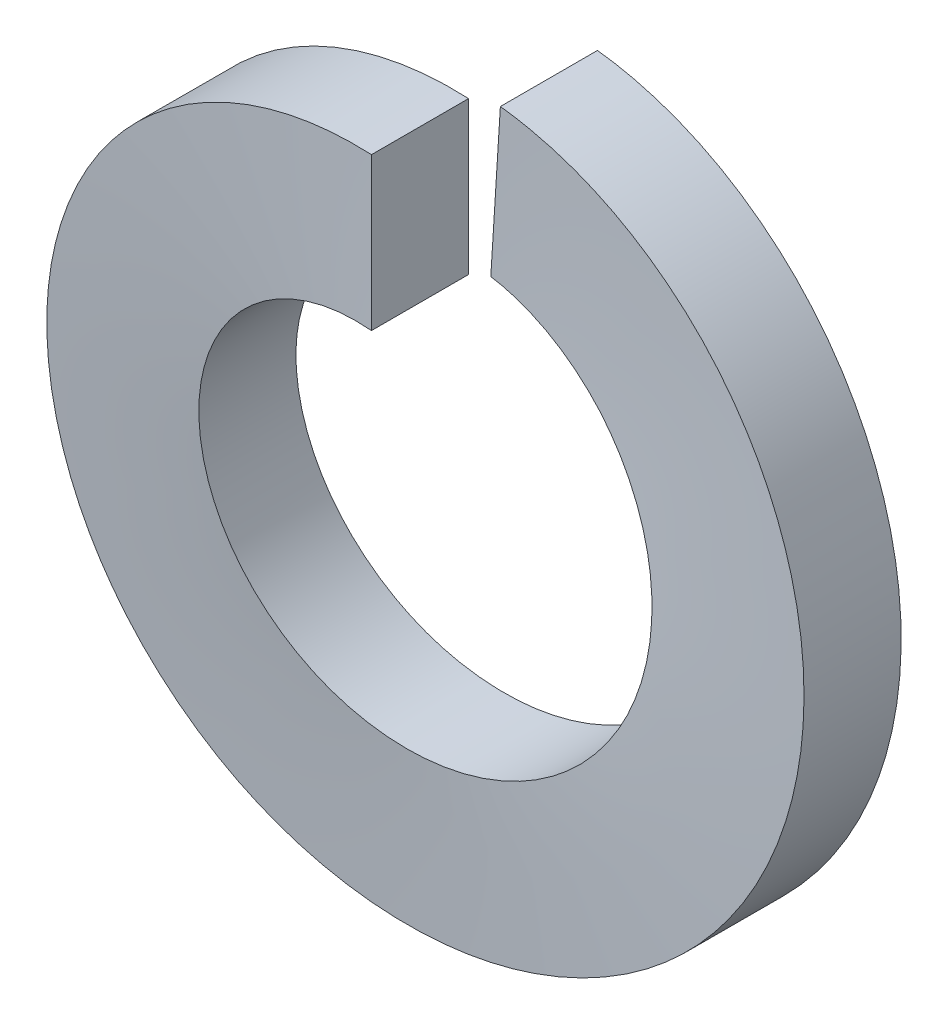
ISO-10303-21;
HEADER;
FILE_DESCRIPTION(('STEP AP214'),'2;1');
FILE_NAME('part.step','',(''),(''),'','','');
FILE_SCHEMA(('AUTOMOTIVE_DESIGN { 1 0 10303 214 1 1 1 1 }'));
ENDSEC;
DATA;
#1=APPLICATION_CONTEXT('core data for automotive mechanical design processes');
#2=APPLICATION_PROTOCOL_DEFINITION('international standard','automotive_design',2000,#1);
#3=PRODUCT_CONTEXT('',#1,'mechanical');
#4=PRODUCT('Part','Part','',(#3));
#5=PRODUCT_RELATED_PRODUCT_CATEGORY('part','',(#4));
#6=PRODUCT_DEFINITION_FORMATION('','',#4);
#7=PRODUCT_DEFINITION_CONTEXT('part definition',#1,'design');
#8=PRODUCT_DEFINITION('design','',#6,#7);
#9=PRODUCT_DEFINITION_SHAPE('','',#8);
#10=(LENGTH_UNIT() NAMED_UNIT(*) SI_UNIT(.MILLI.,.METRE.));
#11=(NAMED_UNIT(*) PLANE_ANGLE_UNIT() SI_UNIT($,.RADIAN.));
#12=(NAMED_UNIT(*) SI_UNIT($,.STERADIAN.) SOLID_ANGLE_UNIT());
#13=UNCERTAINTY_MEASURE_WITH_UNIT(LENGTH_MEASURE(1.E-05),#10,'distance_accuracy_value','');
#14=(GEOMETRIC_REPRESENTATION_CONTEXT(3) GLOBAL_UNCERTAINTY_ASSIGNED_CONTEXT((#13)) GLOBAL_UNIT_ASSIGNED_CONTEXT((#10,
#11,#12)) REPRESENTATION_CONTEXT('',''));
#15=CARTESIAN_POINT('',(0.,0.,0.));
#16=DIRECTION('',(0.,0.,1.));
#17=DIRECTION('',(1.,0.,0.));
#18=AXIS2_PLACEMENT_3D('',#15,#16,#17);
#19=CARTESIAN_POINT('',(0.,6.76275,2.3876));
#20=DIRECTION('',(1.,0.,0.));
#21=DIRECTION('',(0.,0.,-1.));
#22=AXIS2_PLACEMENT_3D('',#19,#20,#21);
#23=PLANE('',#22);
#24=CARTESIAN_POINT('',(0.,8.636,2.3876));
#25=CARTESIAN_POINT('',(0.,4.8895,2.3876));
#26=(BOUNDED_CURVE() B_SPLINE_CURVE(1,(#24,#25),.UNSPECIFIED.,.F.,
.F.) B_SPLINE_CURVE_WITH_KNOTS((2,2),(0.,1.),
.UNSPECIFIED.) CURVE() GEOMETRIC_REPRESENTATION_ITEM() RATIONAL_B_SPLINE_CURVE((1.,1.)) REPRESENTATION_ITEM(''));
#27=CARTESIAN_POINT('',(0.,8.636,2.3876));
#28=VERTEX_POINT('',#27);
#29=CARTESIAN_POINT('',(0.,4.8895,2.3876));
#30=VERTEX_POINT('',#29);
#31=EDGE_CURVE('E57',#28,#30,#26,.T.);
#32=ORIENTED_EDGE('',*,*,#31,.T.);
#33=CARTESIAN_POINT('',(0.,4.8895,2.3876));
#34=CARTESIAN_POINT('',(0.,4.8895,0.));
#35=(BOUNDED_CURVE() B_SPLINE_CURVE(1,(#33,#34),.UNSPECIFIED.,.F.,
.F.) B_SPLINE_CURVE_WITH_KNOTS((2,2),(0.,1.),
.UNSPECIFIED.) CURVE() GEOMETRIC_REPRESENTATION_ITEM() RATIONAL_B_SPLINE_CURVE((1.,1.)) REPRESENTATION_ITEM(''));
#36=CARTESIAN_POINT('',(0.,4.8895,0.));
#37=VERTEX_POINT('',#36);
#38=EDGE_CURVE('E89',#30,#37,#35,.T.);
#39=ORIENTED_EDGE('',*,*,#38,.T.);
#40=CARTESIAN_POINT('',(0.,4.8895,0.));
#41=CARTESIAN_POINT('',(0.,8.636,0.));
#42=(BOUNDED_CURVE() B_SPLINE_CURVE(1,(#40,#41),.UNSPECIFIED.,.F.,
.F.) B_SPLINE_CURVE_WITH_KNOTS((2,2),(0.,1.),
.UNSPECIFIED.) CURVE() GEOMETRIC_REPRESENTATION_ITEM() RATIONAL_B_SPLINE_CURVE((1.,1.)) REPRESENTATION_ITEM(''));
#43=CARTESIAN_POINT('',(0.,8.636,0.));
#44=VERTEX_POINT('',#43);
#45=EDGE_CURVE('E92',#37,#44,#42,.T.);
#46=ORIENTED_EDGE('',*,*,#45,.T.);
#47=CARTESIAN_POINT('',(0.,8.636,0.));
#48=CARTESIAN_POINT('',(0.,8.636,2.3876));
#49=(BOUNDED_CURVE() B_SPLINE_CURVE(1,(#47,#48),.UNSPECIFIED.,.F.,
.F.) B_SPLINE_CURVE_WITH_KNOTS((2,2),(0.,1.),
.UNSPECIFIED.) CURVE() GEOMETRIC_REPRESENTATION_ITEM() RATIONAL_B_SPLINE_CURVE((1.,1.)) REPRESENTATION_ITEM(''));
#50=EDGE_CURVE('E72',#44,#28,#49,.T.);
#51=ORIENTED_EDGE('',*,*,#50,.T.);
#52=EDGE_LOOP('',(#32,#39,#46,#51));
#53=FACE_BOUND('',#52,.T.);
#54=ADVANCED_FACE('F46',(#53),#23,.T.);
#55=CARTESIAN_POINT('',(0.36584590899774,5.81462718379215,-0.239392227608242));
#56=DIRECTION('',(0.998026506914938,-0.0627940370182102,2.0251497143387E-05));
#57=DIRECTION('',(0.0627940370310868,0.998026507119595,0.));
#58=AXIS2_PLACEMENT_3D('',#55,#56,#57);
#59=PLANE('',#58);
#60=CARTESIAN_POINT('',(0.542289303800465,8.61895691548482,-0.239392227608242));
#61=CARTESIAN_POINT('',(0.307031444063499,4.87985060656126,-0.239392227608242));
#62=(BOUNDED_CURVE() B_SPLINE_CURVE(1,(#60,#61),.UNSPECIFIED.,.F.,
.F.) B_SPLINE_CURVE_WITH_KNOTS((2,2),(0.,1.),
.UNSPECIFIED.) CURVE() GEOMETRIC_REPRESENTATION_ITEM() RATIONAL_B_SPLINE_CURVE((0.991096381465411,0.991096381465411)) REPRESENTATION_ITEM(''));
#63=CARTESIAN_POINT('',(0.307049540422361,4.87984946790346,-0.239390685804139));
#64=VERTEX_POINT('',#63);
#65=CARTESIAN_POINT('',(0.542289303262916,8.61895691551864,-0.239392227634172));
#66=VERTEX_POINT('',#65);
#67=EDGE_CURVE('E12',#64,#66,#62,.F.);
#68=ORIENTED_EDGE('',*,*,#67,.T.);
#69=CARTESIAN_POINT('',(0.542289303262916,8.61895691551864,-2.62699222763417));
#70=CARTESIAN_POINT('',(0.542289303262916,8.61895691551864,-0.239392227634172));
#71=(BOUNDED_CURVE() B_SPLINE_CURVE(1,(#69,#70),.UNSPECIFIED.,.F.,
.F.) B_SPLINE_CURVE_WITH_KNOTS((2,2),(0.,1.),
.UNSPECIFIED.) CURVE() GEOMETRIC_REPRESENTATION_ITEM() RATIONAL_B_SPLINE_CURVE((0.99109638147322,0.99109638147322)) REPRESENTATION_ITEM(''));
#72=CARTESIAN_POINT('',(0.542321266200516,8.61895490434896,-2.62699068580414));
#73=VERTEX_POINT('',#72);
#74=EDGE_CURVE('E134',#66,#73,#71,.F.);
#75=ORIENTED_EDGE('',*,*,#74,.T.);
#76=CARTESIAN_POINT('',(0.307067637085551,4.8798483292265,-2.62698914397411));
#77=CARTESIAN_POINT('',(0.542353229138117,8.61895289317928,-2.62698914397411));
#78=(BOUNDED_CURVE() B_SPLINE_CURVE(1,(#76,#77),.UNSPECIFIED.,.F.,
.F.) B_SPLINE_CURVE_WITH_KNOTS((2,2),(0.,1.),
.UNSPECIFIED.) CURVE() GEOMETRIC_REPRESENTATION_ITEM() RATIONAL_B_SPLINE_CURVE((0.991095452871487,0.991095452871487)) REPRESENTATION_ITEM(''));
#79=CARTESIAN_POINT('',(0.307067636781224,4.87984832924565,-2.62698914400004));
#80=VERTEX_POINT('',#79);
#81=EDGE_CURVE('E112',#73,#80,#78,.F.);
#82=ORIENTED_EDGE('',*,*,#81,.T.);
#83=CARTESIAN_POINT('',(0.307067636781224,4.87984832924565,-0.239389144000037));
#84=CARTESIAN_POINT('',(0.307067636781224,4.87984832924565,-2.62698914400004));
#85=(BOUNDED_CURVE() B_SPLINE_CURVE(1,(#83,#84),.UNSPECIFIED.,.F.,
.F.) B_SPLINE_CURVE_WITH_KNOTS((2,2),(0.,1.),
.UNSPECIFIED.) CURVE() GEOMETRIC_REPRESENTATION_ITEM() RATIONAL_B_SPLINE_CURVE((0.991095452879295,0.991095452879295)) REPRESENTATION_ITEM(''));
#86=EDGE_CURVE('E97',#80,#64,#85,.F.);
#87=ORIENTED_EDGE('',*,*,#86,.T.);
#88=EDGE_LOOP('',(#68,#75,#82,#87));
#89=FACE_BOUND('',#88,.T.);
#90=ADVANCED_FACE('F48',(#89),#59,.F.);
#91=CARTESIAN_POINT('',(0.,8.636,2.3876));
#92=CARTESIAN_POINT('',(-2.80600649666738,8.636,2.25495555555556));
#93=CARTESIAN_POINT('',(-5.0761134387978,6.98667076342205,2.12231111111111));
#94=CARTESIAN_POINT('',(-7.34622038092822,5.33734152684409,1.98966666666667));
#95=CARTESIAN_POINT('',(-8.21332407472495,2.66867076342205,1.85702222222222));
#96=CARTESIAN_POINT('',(-9.08042776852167,0.,1.72437777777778));
#97=CARTESIAN_POINT('',(-8.21332407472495,-2.66867076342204,1.59173333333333));
#98=CARTESIAN_POINT('',(-7.34622038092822,-5.33734152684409,1.45908888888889));
#99=CARTESIAN_POINT('',(-5.0761134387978,-6.98667076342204,1.32644444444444));
#100=CARTESIAN_POINT('',(-2.80600649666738,-8.636,1.1938));
#101=CARTESIAN_POINT('',(0.,-8.636,1.06115555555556));
#102=CARTESIAN_POINT('',(2.80600649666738,-8.636,0.928511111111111));
#103=CARTESIAN_POINT('',(5.0761134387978,-6.98667076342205,0.795866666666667));
#104=CARTESIAN_POINT('',(7.34622038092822,-5.33734152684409,0.663222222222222));
#105=CARTESIAN_POINT('',(8.21332407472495,-2.66867076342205,0.530577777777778));
#106=CARTESIAN_POINT('',(9.08042776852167,0.,0.397933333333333));
#107=CARTESIAN_POINT('',(8.21332407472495,2.66867076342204,0.265288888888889));
#108=CARTESIAN_POINT('',(7.34622038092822,5.33734152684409,0.132644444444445));
#109=CARTESIAN_POINT('',(5.0761134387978,6.98667076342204,0.));
#110=CARTESIAN_POINT('',(3.04631129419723,8.46140834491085,-0.118603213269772));
#111=CARTESIAN_POINT('',(0.542289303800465,8.61895691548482,-0.239392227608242));
#112=CARTESIAN_POINT('',(0.,4.8895,2.3876));
#113=CARTESIAN_POINT('',(-1.5886948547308,4.8895,2.25495555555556));
#114=CARTESIAN_POINT('',(-2.87397599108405,3.9556885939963,2.12231111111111));
#115=CARTESIAN_POINT('',(-4.1592571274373,3.02187718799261,1.98966666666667));
#116=CARTESIAN_POINT('',(-4.65019083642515,1.51093859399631,1.85702222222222));
#117=CARTESIAN_POINT('',(-5.14112454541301,0.,1.72437777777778));
#118=CARTESIAN_POINT('',(-4.65019083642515,-1.5109385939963,1.59173333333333));
#119=CARTESIAN_POINT('',(-4.1592571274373,-3.02187718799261,1.45908888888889));
#120=CARTESIAN_POINT('',(-2.87397599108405,-3.9556885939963,1.32644444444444));
#121=CARTESIAN_POINT('',(-1.5886948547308,-4.8895,1.1938));
#122=CARTESIAN_POINT('',(0.,-4.8895,1.06115555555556));
#123=CARTESIAN_POINT('',(1.58869485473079,-4.8895,0.928511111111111));
#124=CARTESIAN_POINT('',(2.87397599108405,-3.9556885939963,0.795866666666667));
#125=CARTESIAN_POINT('',(4.1592571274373,-3.02187718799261,0.663222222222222));
#126=CARTESIAN_POINT('',(4.65019083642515,-1.51093859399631,0.530577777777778));
#127=CARTESIAN_POINT('',(5.14112454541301,0.,0.397933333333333));
#128=CARTESIAN_POINT('',(4.65019083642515,1.5109385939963,0.265288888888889));
#129=CARTESIAN_POINT('',(4.1592571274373,3.02187718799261,0.132644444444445));
#130=CARTESIAN_POINT('',(2.87397599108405,3.9556885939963,0.));
#131=CARTESIAN_POINT('',(1.72474977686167,4.79065031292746,-0.118603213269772));
#132=CARTESIAN_POINT('',(0.307031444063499,4.87985060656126,-0.239392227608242));
#133=(BOUNDED_SURFACE() B_SPLINE_SURFACE(1,2,((#91,#92,#93,#94,#95,#96,#97,#98,#99,#100,#101,
#102,#103,#104,#105,#106,#107,#108,#109,#110,#111),(#112,#113,#114,#115,#116,#117,#118,#119,
#120,#121,#122,#123,#124,#125,#126,#127,#128,#129,#130,#131,#132)),.UNSPECIFIED.,.F.,.F.,
.F.) B_SPLINE_SURFACE_WITH_KNOTS((2,2),(3,2,2,2,2,2,2,2,2,2,3),(0.,1.),(0.,0.1,0.2,0.3,0.4,0.5,
0.6,0.7,0.8,0.9,0.989880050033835),
.UNSPECIFIED.) GEOMETRIC_REPRESENTATION_ITEM() RATIONAL_B_SPLINE_SURFACE(((1.,0.951056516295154,
1.,0.951056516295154,1.,0.951056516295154,1.,0.951056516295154,1.,0.951056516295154,1.,
0.951056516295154,1.,0.951056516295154,1.,0.951056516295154,1.,0.951056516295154,1.,
0.956009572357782,0.991096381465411),(1.,0.951056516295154,1.,0.951056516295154,1.,
0.951056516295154,1.,0.951056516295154,1.,0.951056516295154,1.,0.951056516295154,1.,
0.951056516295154,1.,0.951056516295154,1.,0.951056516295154,1.,0.956009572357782,0.991096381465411))) REPRESENTATION_ITEM('') SURFACE());
#134=CARTESIAN_POINT('',(0.,8.636,2.3876));
#135=CARTESIAN_POINT('',(-2.80600649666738,8.636,2.25495555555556));
#136=CARTESIAN_POINT('',(-5.0761134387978,6.98667076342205,2.12231111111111));
#137=CARTESIAN_POINT('',(-7.34622038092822,5.33734152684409,1.98966666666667));
#138=CARTESIAN_POINT('',(-8.21332407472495,2.66867076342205,1.85702222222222));
#139=CARTESIAN_POINT('',(-9.08042776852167,0.,1.72437777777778));
#140=CARTESIAN_POINT('',(-8.21332407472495,-2.66867076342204,1.59173333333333));
#141=CARTESIAN_POINT('',(-7.34622038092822,-5.33734152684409,1.45908888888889));
#142=CARTESIAN_POINT('',(-5.0761134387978,-6.98667076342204,1.32644444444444));
#143=CARTESIAN_POINT('',(-2.80600649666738,-8.636,1.1938));
#144=CARTESIAN_POINT('',(0.,-8.636,1.06115555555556));
#145=CARTESIAN_POINT('',(2.80600649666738,-8.636,0.928511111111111));
#146=CARTESIAN_POINT('',(5.0761134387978,-6.98667076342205,0.795866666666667));
#147=CARTESIAN_POINT('',(7.34622038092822,-5.33734152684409,0.663222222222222));
#148=CARTESIAN_POINT('',(8.21332407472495,-2.66867076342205,0.530577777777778));
#149=CARTESIAN_POINT('',(9.08042776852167,0.,0.397933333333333));
#150=CARTESIAN_POINT('',(8.21332407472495,2.66867076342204,0.265288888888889));
#151=CARTESIAN_POINT('',(7.34622038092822,5.33734152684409,0.132644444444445));
#152=CARTESIAN_POINT('',(5.0761134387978,6.98667076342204,0.));
#153=CARTESIAN_POINT('',(3.04631129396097,8.4614083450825,-0.118603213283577));
#154=CARTESIAN_POINT('',(0.542289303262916,8.61895691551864,-0.239392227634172));
#155=(BOUNDED_CURVE() B_SPLINE_CURVE(2,(#134,#135,#136,#137,#138,#139,#140,#141,#142,#143,#144,
#145,#146,#147,#148,#149,#150,#151,#152,#153,#154),.UNSPECIFIED.,.F.,
.F.) B_SPLINE_CURVE_WITH_KNOTS((3,2,2,2,2,2,2,2,2,2,3),(0.,0.1,0.2,0.3,0.4,0.5,0.6,0.7,0.8,0.9,
0.989880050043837),
.UNSPECIFIED.) CURVE() GEOMETRIC_REPRESENTATION_ITEM() RATIONAL_B_SPLINE_CURVE((1.,
0.951056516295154,1.,0.951056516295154,1.,0.951056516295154,1.,0.951056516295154,1.,
0.951056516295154,1.,0.951056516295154,1.,0.951056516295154,1.,0.951056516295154,1.,
0.951056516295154,1.,0.956009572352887,0.99109638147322)) REPRESENTATION_ITEM(''));
#156=EDGE_CURVE('E64',#28,#66,#155,.T.);
#157=CARTESIAN_POINT('',(0.,4.8895,2.3876));
#158=CARTESIAN_POINT('',(-0.0568061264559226,4.8895004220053,2.38285711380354));
#159=CARTESIAN_POINT('',(-0.113609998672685,4.88851005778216,2.37808753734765));
#160=CARTESIAN_POINT('',(-0.227428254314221,4.88454135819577,2.36847687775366));
#161=CARTESIAN_POINT('',(-0.284442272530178,4.88155312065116,2.36363555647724));
#162=CARTESIAN_POINT('',(-0.398576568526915,4.87356483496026,2.35388946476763));
#163=CARTESIAN_POINT('',(-0.455696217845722,4.86855603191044,2.34898450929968));
#164=CARTESIAN_POINT('',(-0.569935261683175,4.85651060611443,2.33911960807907));
#165=CARTESIAN_POINT('',(-0.627053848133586,4.84946643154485,2.33415952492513));
#166=CARTESIAN_POINT('',(-0.7411825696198,4.8333415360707,2.32419316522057));
#167=CARTESIAN_POINT('',(-0.798191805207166,4.82425450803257,2.31918679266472));
#168=CARTESIAN_POINT('',(-0.911992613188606,4.80404286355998,2.3091369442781));
#169=CARTESIAN_POINT('',(-0.96878328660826,4.79291321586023,2.30409340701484));
#170=CARTESIAN_POINT('',(-1.08203741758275,4.76862303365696,2.2939785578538));
#171=CARTESIAN_POINT('',(-1.13850007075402,4.7554587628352,2.28890721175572));
#172=CARTESIAN_POINT('',(-1.25098895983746,4.72711384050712,2.278746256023));
#173=CARTESIAN_POINT('',(-1.30701458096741,4.71193075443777,2.27365663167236));
#174=CARTESIAN_POINT('',(-1.41852125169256,4.67957047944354,2.26346875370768));
#175=CARTESIAN_POINT('',(-1.47400197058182,4.66239215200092,2.25837049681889));
#176=CARTESIAN_POINT('',(-1.58431242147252,4.62607134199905,2.24817505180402));
#177=CARTESIAN_POINT('',(-1.6391421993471,4.60692899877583,2.2430778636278));
#178=CARTESIAN_POINT('',(-1.74804676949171,4.56671759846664,2.23289425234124));
#179=CARTESIAN_POINT('',(-1.80212207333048,4.54564992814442,2.22780782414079));
#180=CARTESIAN_POINT('',(-1.90941676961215,4.50163256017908,2.21765538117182));
#181=CARTESIAN_POINT('',(-1.96263722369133,4.47868545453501,2.21258934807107));
#182=CARTESIAN_POINT('',(-2.06812498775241,4.43096083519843,2.20248717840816));
#183=CARTESIAN_POINT('',(-2.12039398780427,4.40618706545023,2.19745100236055));
#184=CARTESIAN_POINT('',(-2.22388590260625,4.35486728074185,2.1874180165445));
#185=CARTESIAN_POINT('',(-2.27511120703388,4.32832609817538,2.18242113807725));
#186=CARTESIAN_POINT('',(-2.37642756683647,4.27353579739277,2.17247536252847));
#187=CARTESIAN_POINT('',(-2.42652177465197,4.24529252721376,2.16752636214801));
#188=CARTESIAN_POINT('',(-2.52549323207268,4.18716787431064,2.15768696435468));
#189=CARTESIAN_POINT('',(-2.5743744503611,4.15729327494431,2.15279641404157));
#190=CARTESIAN_POINT('',(-2.67084238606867,4.09598131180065,2.14307567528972));
#191=CARTESIAN_POINT('',(-2.71843393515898,4.0645515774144,2.13824531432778));
#192=CARTESIAN_POINT('',(-2.81226580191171,4.00019897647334,2.12867663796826));
#193=CARTESIAN_POINT('',(-2.85851153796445,3.96728405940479,2.12393799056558));
#194=CARTESIAN_POINT('',(-2.94992072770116,3.89979644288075,2.11441726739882));
#195=CARTESIAN_POINT('',(-2.99508175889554,3.86522047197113,2.10963512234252));
#196=CARTESIAN_POINT('',(-3.08438331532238,3.79434514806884,2.09999613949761));
#197=CARTESIAN_POINT('',(-3.12851781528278,3.75803823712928,2.09513905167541));
#198=CARTESIAN_POINT('',(-3.21566914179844,3.6837446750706,2.0853645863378));
#199=CARTESIAN_POINT('',(-3.25868042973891,3.64575154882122,2.08044704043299));
#200=CARTESIAN_POINT('',(-3.34349016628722,3.56813675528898,2.07055850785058));
#201=CARTESIAN_POINT('',(-3.38528365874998,3.52850968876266,2.06558739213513));
#202=CARTESIAN_POINT('',(-3.46756594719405,3.44768506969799,2.05560104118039));
#203=CARTESIAN_POINT('',(-3.50805046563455,3.40648317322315,2.05058571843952));
#204=CARTESIAN_POINT('',(-3.5876267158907,3.32257369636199,2.04051997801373));
#205=CARTESIAN_POINT('',(-3.62671494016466,3.27986279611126,2.03546950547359));
#206=CARTESIAN_POINT('',(-3.70341493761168,3.19300650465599,2.02534287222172));
#207=CARTESIAN_POINT('',(-3.74102405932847,3.14885877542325,2.02026668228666));
#208=CARTESIAN_POINT('',(-3.81468717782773,3.05920603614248,2.01009814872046));
#209=CARTESIAN_POINT('',(-3.85073945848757,3.01369961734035,2.00500579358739));
#210=CARTESIAN_POINT('',(-3.92121575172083,2.92141227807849,1.99481458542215));
#211=CARTESIAN_POINT('',(-3.95563905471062,2.87463081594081,1.98971573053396));
#212=CARTESIAN_POINT('',(-4.02279026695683,2.77988123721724,1.97952122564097));
#213=CARTESIAN_POINT('',(-4.05551853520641,2.73191337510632,1.9744255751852));
#214=CARTESIAN_POINT('',(-4.11921900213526,2.63488336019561,1.96424716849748));
#215=CARTESIAN_POINT('',(-4.1501926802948,2.58582217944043,1.95916440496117));
#216=CARTESIAN_POINT('',(-4.2103301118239,2.48670181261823,1.94902139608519));
#217=CARTESIAN_POINT('',(-4.23949650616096,2.43664423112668,1.94396112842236));
#218=CARTESIAN_POINT('',(-4.29597263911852,2.33563064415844,1.93387257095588));
#219=CARTESIAN_POINT('',(-4.32328620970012,2.28467678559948,1.92884423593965));
#220=CARTESIAN_POINT('',(-4.37601732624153,2.1819728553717,1.91882892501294));
#221=CARTESIAN_POINT('',(-4.40143991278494,2.13022537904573,1.91384187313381));
#222=CARTESIAN_POINT('',(-4.45035720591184,2.02603842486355,1.90391783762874));
#223=CARTESIAN_POINT('',(-4.47385816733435,1.97360189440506,1.89898074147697));
#224=CARTESIAN_POINT('',(-4.51890799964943,1.86814220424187,1.88916659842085));
#225=CARTESIAN_POINT('',(-4.54046433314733,1.8151222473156,1.8842893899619));
#226=CARTESIAN_POINT('',(-4.58160820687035,1.70860215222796,1.87459881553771));
#227=CARTESIAN_POINT('',(-4.60120439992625,1.65510537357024,1.8697852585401));
#228=CARTESIAN_POINT('',(-4.63843937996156,1.54767839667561,1.86024188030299));
#229=CARTESIAN_POINT('',(-4.65608596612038,1.49375092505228,1.85551179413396));
#230=CARTESIAN_POINT('',(-4.68955011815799,1.38512510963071,1.8459786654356));
#231=CARTESIAN_POINT('',(-4.70536091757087,1.33042469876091,1.84117542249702));
#232=CARTESIAN_POINT('',(-4.73513189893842,1.22024902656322,1.83150233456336));
#233=CARTESIAN_POINT('',(-4.74908298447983,1.16477132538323,1.82663228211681));
#234=CARTESIAN_POINT('',(-4.77508270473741,1.05313511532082,1.81683202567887));
#235=CARTESIAN_POINT('',(-4.78712328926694,0.996974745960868,1.81190165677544));
#236=CARTESIAN_POINT('',(-4.80925659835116,0.884071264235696,1.80198986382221));
#237=CARTESIAN_POINT('',(-4.8193423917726,0.827326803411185,1.79700832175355));
#238=CARTESIAN_POINT('',(-4.83752743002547,0.713356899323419,1.78700298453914));
#239=CARTESIAN_POINT('',(-4.84562092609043,0.656130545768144,1.78197910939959));
#240=CARTESIAN_POINT('',(-4.85978978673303,0.541301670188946,1.77189834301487));
#241=CARTESIAN_POINT('',(-4.86586063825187,0.483698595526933,1.76684140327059));
#242=CARTESIAN_POINT('',(-4.87596001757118,0.368223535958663,1.75670391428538));
#243=CARTESIAN_POINT('',(-4.87998531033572,0.310351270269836,1.75162334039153));
#244=CARTESIAN_POINT('',(-4.88597699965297,0.194446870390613,1.74144815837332));
#245=CARTESIAN_POINT('',(-4.8879414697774,0.136414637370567,1.73635354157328));
#246=CARTESIAN_POINT('',(-4.88980271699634,0.0203004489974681,1.72615994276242));
#247=CARTESIAN_POINT('',(-4.8896988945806,-0.0377815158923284,1.72106095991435));
#248=CARTESIAN_POINT('',(-4.88742261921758,-0.153884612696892,1.71086833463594));
#249=CARTESIAN_POINT('',(-4.88525089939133,-0.211905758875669,1.7057746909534));
#250=CARTESIAN_POINT('',(-4.87884575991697,-0.327776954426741,1.6956024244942));
#251=CARTESIAN_POINT('',(-4.87461439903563,-0.385627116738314,1.69052379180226));
#252=CARTESIAN_POINT('',(-4.86410471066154,-0.501047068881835,1.68039113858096));
#253=CARTESIAN_POINT('',(-4.85782974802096,-0.558617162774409,1.67533709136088));
#254=CARTESIAN_POINT('',(-4.8432552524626,-0.673369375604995,1.66526306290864));
#255=CARTESIAN_POINT('',(-4.83496035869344,-0.73055207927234,1.66024303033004));
#256=CARTESIAN_POINT('',(-4.81637585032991,-0.84442424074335,1.65024624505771));
#257=CARTESIAN_POINT('',(-4.80609210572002,-0.901114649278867,1.64526940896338));
#258=CARTESIAN_POINT('',(-4.78356691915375,-1.01389992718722,1.63536810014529));
#259=CARTESIAN_POINT('',(-4.77133252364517,-1.06999619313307,1.63044350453));
#260=CARTESIAN_POINT('',(-4.7449498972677,-1.18149441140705,1.62065496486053));
#261=CARTESIAN_POINT('',(-4.73080982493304,-1.23689827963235,1.61579085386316));
#262=CARTESIAN_POINT('',(-4.7006661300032,-1.34691719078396,1.60613300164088));
#263=CARTESIAN_POINT('',(-4.68467170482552,-1.40153473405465,1.60133903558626));
#264=CARTESIAN_POINT('',(-4.65083458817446,-1.51002211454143,1.5918125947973));
#265=CARTESIAN_POINT('',(-4.63299747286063,-1.5638936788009,1.58707998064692));
#266=CARTESIAN_POINT('',(-4.59537553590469,-1.67122188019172,1.57752610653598));
#267=CARTESIAN_POINT('',(-4.57558221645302,-1.72467551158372,1.57270454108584));
#268=CARTESIAN_POINT('',(-4.53404514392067,-1.83109872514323,1.56299989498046));
#269=CARTESIAN_POINT('',(-4.51229285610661,-1.8840649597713,1.55811663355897));
#270=CARTESIAN_POINT('',(-4.46685297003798,-1.98940651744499,1.54829093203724));
#271=CARTESIAN_POINT('',(-4.44315802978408,-2.04177865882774,1.54334833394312));
#272=CARTESIAN_POINT('',(-4.3938553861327,-2.14582625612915,1.5334142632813));
#273=CARTESIAN_POINT('',(-4.36824154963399,-2.19749879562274,1.52842268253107));
#274=CARTESIAN_POINT('',(-4.31513130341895,-2.30004241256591,1.51839920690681));
#275=CARTESIAN_POINT('',(-4.28762997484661,-2.35091093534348,1.51336723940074));
#276=CARTESIAN_POINT('',(-4.23078244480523,-2.45174362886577,1.50327236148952));
#277=CARTESIAN_POINT('',(-4.20143253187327,-2.50170570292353,1.49820940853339));
#278=CARTESIAN_POINT('',(-4.14093291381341,-2.60062511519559,1.48806198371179));
#279=CARTESIAN_POINT('',(-4.10978068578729,-2.64958090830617,1.48297749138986));
#280=CARTESIAN_POINT('',(-4.04572867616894,-2.74639055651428,1.47279659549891));
#281=CARTESIAN_POINT('',(-4.01282752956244,-2.79424350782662,1.46770018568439));
#282=CARTESIAN_POINT('',(-3.94533679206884,-2.88875408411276,1.45750513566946));
#283=CARTESIAN_POINT('',(-3.9107469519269,-2.93541153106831,1.45240649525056));
#284=CARTESIAN_POINT('',(-3.83994445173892,-3.02744212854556,1.44221668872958));
#285=CARTESIAN_POINT('',(-3.80373260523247,-3.07281590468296,1.43712552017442));
#286=CARTESIAN_POINT('',(-3.72975781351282,-3.16219517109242,1.42696032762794));
#287=CARTESIAN_POINT('',(-3.69199668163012,-3.20620216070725,1.42188629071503));
#288=CARTESIAN_POINT('',(-3.61500066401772,-3.29276935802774,1.41176491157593));
#289=CARTESIAN_POINT('',(-3.57576851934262,-3.3353320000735,1.40671753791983));
#290=CARTESIAN_POINT('',(-3.49591291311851,-3.41893796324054,1.3966589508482));
#291=CARTESIAN_POINT('',(-3.45529304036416,-3.45998470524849,1.39164767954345));
#292=CARTESIAN_POINT('',(-3.37274896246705,-3.54049266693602,1.38167026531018));
#293=CARTESIAN_POINT('',(-3.33082910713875,-3.57995833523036,1.37670403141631));
#294=CARTESIAN_POINT('',(-3.24577590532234,-3.65724468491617,1.36682642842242));
#295=CARTESIAN_POINT('',(-3.20264757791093,-3.69507087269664,1.36191492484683));
#296=CARTESIAN_POINT('',(-3.11527182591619,-3.76902555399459,1.35215233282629));
#297=CARTESIAN_POINT('',(-3.0710299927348,-3.80516063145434,1.34730107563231));
#298=CARTESIAN_POINT('',(-2.98152332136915,-3.8756882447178,1.33767848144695));
#299=CARTESIAN_POINT('',(-2.93626455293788,-3.91008844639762,1.33290686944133));
#300=CARTESIAN_POINT('',(-2.84462798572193,-3.97725093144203,1.32338904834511));
#301=CARTESIAN_POINT('',(-2.79825157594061,-4.01001510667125,1.3186428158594));
#302=CARTESIAN_POINT('',(-2.70415650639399,-4.07406470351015,1.30905982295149));
#303=CARTESIAN_POINT('',(-2.65643230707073,-4.10534193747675,1.30422272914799));
#304=CARTESIAN_POINT('',(-2.55970637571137,-4.16634098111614,1.29448909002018));
#305=CARTESIAN_POINT('',(-2.51069990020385,-4.1960552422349,1.28959237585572));
#306=CARTESIAN_POINT('',(-2.41148581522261,-4.25385178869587,1.27974158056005));
#307=CARTESIAN_POINT('',(-2.36127432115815,-4.28192738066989,1.27478735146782));
#308=CARTESIAN_POINT('',(-2.25973184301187,-4.3363754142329,1.2648319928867));
#309=CARTESIAN_POINT('',(-2.20839778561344,-4.36274210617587,1.25983076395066));
#310=CARTESIAN_POINT('',(-2.10469733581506,-4.41370657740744,1.24979000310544));
#311=CARTESIAN_POINT('',(-2.05232862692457,-4.43829963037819,1.24475040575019));
#312=CARTESIAN_POINT('',(-1.94665088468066,-4.4856571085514,1.23464233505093));
#313=CARTESIAN_POINT('',(-1.89334022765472,-4.50841790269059,1.22957382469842));
#314=CARTESIAN_POINT('',(-1.78587497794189,-4.5520576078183,1.21941738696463));
#315=CARTESIAN_POINT('',(-1.73171938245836,-4.57293404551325,1.21432944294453));
#316=CARTESIAN_POINT('',(-1.62266443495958,-4.61275864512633,1.2041437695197));
#317=CARTESIAN_POINT('',(-1.56776462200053,-4.63170554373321,1.19904603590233));
#318=CARTESIAN_POINT('',(-1.45732459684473,-4.66763186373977,1.1888504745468));
#319=CARTESIAN_POINT('',(-1.40178438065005,-4.68461127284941,1.18375264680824));
#320=CARTESIAN_POINT('',(-1.2901694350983,-4.71657086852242,1.17356659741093));
#321=CARTESIAN_POINT('',(-1.23409506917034,-4.73155232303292,1.16847837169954));
#322=CARTESIAN_POINT('',(-1.12151956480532,-4.75949191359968,1.15832118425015));
#323=CARTESIAN_POINT('',(-1.06501906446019,-4.77245261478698,1.15325220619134));
#324=CARTESIAN_POINT('',(-0.951700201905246,-4.79633437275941,1.1431430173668));
#325=CARTESIAN_POINT('',(-0.894882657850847,-4.80725929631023,1.1381027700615));
#326=CARTESIAN_POINT('',(-0.78103907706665,-4.82706098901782,1.12806052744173));
#327=CARTESIAN_POINT('',(-0.7240139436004,-4.8359429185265,1.12305846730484));
#328=CARTESIAN_POINT('',(-0.609864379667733,-4.85165790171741,1.11310128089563));
#329=CARTESIAN_POINT('',(-0.552740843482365,-4.85849738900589,1.10814605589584));
#330=CARTESIAN_POINT('',(-0.43850259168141,-4.87013445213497,1.09829306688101));
#331=CARTESIAN_POINT('',(-0.381388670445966,-4.87493970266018,1.09339515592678));
#332=CARTESIAN_POINT('',(-0.267276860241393,-4.88252277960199,1.08365908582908));
#333=CARTESIAN_POINT('',(-0.210279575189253,-4.88530947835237,1.07882075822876));
#334=CARTESIAN_POINT('',(-0.0965004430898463,-4.8888772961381,1.06923479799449));
#335=CARTESIAN_POINT('',(-0.0397189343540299,-4.88966832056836,1.06448683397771));
#336=CARTESIAN_POINT('',(0.0738928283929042,-4.88927196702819,1.05496937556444));
#337=CARTESIAN_POINT('',(0.130723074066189,-4.88808260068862,1.05019986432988));
#338=CARTESIAN_POINT('',(0.244582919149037,-4.88371285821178,1.04058049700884));
#339=CARTESIAN_POINT('',(0.301612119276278,-4.88052269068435,1.03573036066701));
#340=CARTESIAN_POINT('',(0.415766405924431,-4.87212869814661,1.02597007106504));
#341=CARTESIAN_POINT('',(0.472890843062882,-4.8669162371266,1.02105974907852));
#342=CARTESIAN_POINT('',(0.587128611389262,-4.85446225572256,1.01118428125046));
#343=CARTESIAN_POINT('',(0.644241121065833,-4.8472133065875,1.00621899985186));
#344=CARTESIAN_POINT('',(0.758346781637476,-4.8306784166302,0.996243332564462));
#345=CARTESIAN_POINT('',(0.815339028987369,-4.82138629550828,0.991232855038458));
#346=CARTESIAN_POINT('',(0.929094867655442,-4.80076478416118,0.981175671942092));
#347=CARTESIAN_POINT('',(0.985857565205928,-4.78943049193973,0.976128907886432));
#348=CARTESIAN_POINT('',(1.09904476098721,-4.76473212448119,0.966008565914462));
#349=CARTESIAN_POINT('',(1.15546846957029,-4.75136444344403,0.960934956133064));
#350=CARTESIAN_POINT('',(1.26786855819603,-4.72261458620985,0.950770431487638));
#351=CARTESIAN_POINT('',(1.32384434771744,-4.70723010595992,0.945679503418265));
#352=CARTESIAN_POINT('',(1.43524058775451,-4.67446970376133,0.935489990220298));
#353=CARTESIAN_POINT('',(1.49066074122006,-4.65709277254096,0.930391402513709));
#354=CARTESIAN_POINT('',(1.60083950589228,-4.62037817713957,0.920196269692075));
#355=CARTESIAN_POINT('',(1.6555982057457,-4.6010407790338,0.915099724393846));
#356=CARTESIAN_POINT('',(1.76435034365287,-4.56044343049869,0.904918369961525));
#357=CARTESIAN_POINT('',(1.81834434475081,-4.53918498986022,0.899833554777));
#358=CARTESIAN_POINT('',(1.92546650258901,-4.49479095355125,0.889685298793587));
#359=CARTESIAN_POINT('',(1.97859578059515,-4.47165806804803,0.884621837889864));
#360=CARTESIAN_POINT('',(2.08389166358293,-4.42356743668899,0.874525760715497));
#361=CARTESIAN_POINT('',(2.13606002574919,-4.39861354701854,0.869493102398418));
#362=CARTESIAN_POINT('',(2.23934159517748,-4.34693970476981,0.859468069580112));
#363=CARTESIAN_POINT('',(2.29045726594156,-4.32022468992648,0.85447562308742));
#364=CARTESIAN_POINT('',(2.39154580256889,-4.26509349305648,0.844539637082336));
#365=CARTESIAN_POINT('',(2.44152190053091,-4.23668325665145,0.839595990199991));
#366=CARTESIAN_POINT('',(2.54024912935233,-4.17823198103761,0.829768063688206));
#367=CARTESIAN_POINT('',(2.58900431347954,-4.1481978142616,0.824883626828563));
#368=CARTESIAN_POINT('',(2.68521280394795,-4.08657448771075,0.815176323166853));
#369=CARTESIAN_POINT('',(2.73267103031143,-4.05499303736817,0.810353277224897));
#370=CARTESIAN_POINT('',(2.82624345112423,-3.99033547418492,0.800797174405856));
#371=CARTESIAN_POINT('',(2.8723628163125,-3.95726689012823,0.796063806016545));
#372=CARTESIAN_POINT('',(2.96354784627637,-3.889451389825,0.786538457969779));
#373=CARTESIAN_POINT('',(3.00861017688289,-3.85470000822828,0.781746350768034));
#374=CARTESIAN_POINT('',(3.09770466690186,-3.78347779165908,0.772091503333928));
#375=CARTESIAN_POINT('',(3.14173084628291,-3.74699950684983,0.76722853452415));
#376=CARTESIAN_POINT('',(3.22865580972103,-3.67236804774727,0.757442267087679));
#377=CARTESIAN_POINT('',(3.27154910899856,-3.63420850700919,0.752518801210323));
#378=CARTESIAN_POINT('',(3.35611351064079,-3.55626638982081,0.742619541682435));
#379=CARTESIAN_POINT('',(3.39777972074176,-3.51647852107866,0.737643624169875));
#380=CARTESIAN_POINT('',(3.47979841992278,-3.43533850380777,0.727648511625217));
#381=CARTESIAN_POINT('',(3.5201467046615,-3.39398211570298,0.72262923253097));
#382=CARTESIAN_POINT('',(3.59944188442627,-3.30977051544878,0.712556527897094));
#383=CARTESIAN_POINT('',(3.6383853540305,-3.26691208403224,0.70750305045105));
#384=CARTESIAN_POINT('',(3.7147877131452,-3.17976821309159,0.697371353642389));
#385=CARTESIAN_POINT('',(3.75224404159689,-3.13548053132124,0.692293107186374));
#386=CARTESIAN_POINT('',(3.82559397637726,-3.04555594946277,0.682121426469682));
#387=CARTESIAN_POINT('',(3.86148596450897,-2.9999177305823,0.677027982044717));
#388=CARTESIAN_POINT('',(3.93163465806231,-2.90737538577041,0.666835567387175));
#389=CARTESIAN_POINT('',(3.96589075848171,-2.86047080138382,0.661736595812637));
#390=CARTESIAN_POINT('',(4.03270117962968,-2.76548405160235,0.651542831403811));
#391=CARTESIAN_POINT('',(4.06525596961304,-2.71740221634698,0.646448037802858));
#392=CARTESIAN_POINT('',(4.12860376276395,-2.62015374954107,0.636272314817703));
#393=CARTESIAN_POINT('',(4.15939836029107,-2.57098815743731,0.631191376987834));
#394=CARTESIAN_POINT('',(4.21917261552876,-2.47166882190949,0.62105297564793));
#395=CARTESIAN_POINT('',(4.2481550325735,-2.42151674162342,0.615995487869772));
#396=CARTESIAN_POINT('',(4.30425892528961,-2.32032430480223,0.605913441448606));
#397=CARTESIAN_POINT('',(4.33138435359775,-2.26928614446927,0.600888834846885));
#398=CARTESIAN_POINT('',(4.38373564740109,-2.16642398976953,0.590881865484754));
#399=CARTESIAN_POINT('',(4.40896667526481,-2.11460263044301,0.585899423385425));
#400=CARTESIAN_POINT('',(4.45749807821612,-2.01027843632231,0.575985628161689));
#401=CARTESIAN_POINT('',(4.48080482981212,-1.95777857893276,0.571054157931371));
#402=CARTESIAN_POINT('',(4.52546421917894,-1.85220290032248,0.561251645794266));
#403=CARTESIAN_POINT('',(4.54682443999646,-1.79913030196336,0.556380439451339));
#404=CARTESIAN_POINT('',(4.58757488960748,-1.69251543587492,0.546704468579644));
#405=CARTESIAN_POINT('',(4.60697388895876,-1.63897653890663,0.541899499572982));
#406=CARTESIAN_POINT('',(4.64382369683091,-1.53144694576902,0.532364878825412));
#407=CARTESIAN_POINT('',(4.66128139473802,-1.47745862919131,0.527635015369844));
#408=CARTESIAN_POINT('',(4.6943734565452,-1.36869023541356,0.518093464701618));
#409=CARTESIAN_POINT('',(4.71000007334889,-1.31390782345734,0.513281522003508));
#410=CARTESIAN_POINT('',(4.73939726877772,-1.20357721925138,0.503593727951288));
#411=CARTESIAN_POINT('',(4.75315885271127,-1.14802664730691,0.498717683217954));
#412=CARTESIAN_POINT('',(4.77877470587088,-1.03625439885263,0.488905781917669));
#413=CARTESIAN_POINT('',(4.79062103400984,-0.980030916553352,0.483969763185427));
#414=CARTESIAN_POINT('',(4.81236164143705,-0.867011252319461,0.474047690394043));
#415=CARTESIAN_POINT('',(4.82224910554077,-0.810213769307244,0.469061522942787));
#416=CARTESIAN_POINT('',(4.8400339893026,-0.696148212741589,0.459047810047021));
#417=CARTESIAN_POINT('',(4.84792578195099,-0.638879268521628,0.454020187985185));
#418=CARTESIAN_POINT('',(4.8616884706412,-0.523975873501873,0.443932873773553));
#419=CARTESIAN_POINT('',(4.86755498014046,-0.46634090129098,0.438873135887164));
#420=CARTESIAN_POINT('',(4.87724366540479,-0.350812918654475,0.428731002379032));
#421=CARTESIAN_POINT('',(4.88106273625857,-0.292919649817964,0.423648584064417));
#422=CARTESIAN_POINT('',(4.88664074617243,-0.176984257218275,0.413470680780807));
#423=CARTESIAN_POINT('',(4.88839789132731,-0.118942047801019,0.408375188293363));
#424=CARTESIAN_POINT('',(4.88984403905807,-0.00281899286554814,0.398180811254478));
#425=CARTESIAN_POINT('',(4.88953257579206,0.0552618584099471,0.39308192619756));
#426=CARTESIAN_POINT('',(4.88684135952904,0.171351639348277,0.382890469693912));
#427=CARTESIAN_POINT('',(4.88446247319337,0.229360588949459,0.377797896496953));
#428=CARTESIAN_POINT('',(4.87764412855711,0.345196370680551,0.367628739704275));
#429=CARTESIAN_POINT('',(4.87320686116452,0.403023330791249,0.362552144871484));
#430=CARTESIAN_POINT('',(4.862287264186,0.518385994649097,0.352424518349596));
#431=CARTESIAN_POINT('',(4.85580842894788,0.575922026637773,0.347373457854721));
#432=CARTESIAN_POINT('',(4.84082885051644,0.690595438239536,0.337306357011));
#433=CARTESIAN_POINT('',(4.83233287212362,0.747733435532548,0.332290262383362));
#434=CARTESIAN_POINT('',(4.81334959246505,0.861505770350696,0.322302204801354));
#435=CARTESIAN_POINT('',(4.80286828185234,0.918141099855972,0.317330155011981));
#436=CARTESIAN_POINT('',(4.77995205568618,1.03080615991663,0.307439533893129));
#437=CARTESIAN_POINT('',(4.76752430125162,1.08683733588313,0.302520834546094));
#438=CARTESIAN_POINT('',(4.74075974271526,1.1981956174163,0.292744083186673));
#439=CARTESIAN_POINT('',(4.72643120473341,1.25352469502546,0.287885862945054));
#440=CARTESIAN_POINT('',(4.69591588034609,1.36338502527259,0.278243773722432));
#441=CARTESIAN_POINT('',(4.67973839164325,1.41791883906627,0.273459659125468));
#442=CARTESIAN_POINT('',(4.64552738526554,1.5262719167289,0.26393817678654));
#443=CARTESIAN_POINT('',(4.62749804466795,1.58009249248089,0.25920072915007));
#444=CARTESIAN_POINT('',(4.58948731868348,1.68732573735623,0.249634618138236));
#445=CARTESIAN_POINT('',(4.56949694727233,1.74073519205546,0.244805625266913));
#446=CARTESIAN_POINT('',(4.52756691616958,1.847059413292,0.235087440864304));
#447=CARTESIAN_POINT('',(4.5056188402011,1.89997084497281,0.23019807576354));
#448=CARTESIAN_POINT('',(4.45978930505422,2.00519212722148,0.220360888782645));
#449=CARTESIAN_POINT('',(4.43590062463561,2.05749881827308,0.215412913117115));
#450=CARTESIAN_POINT('',(4.38621318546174,2.161404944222,0.205469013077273));
#451=CARTESIAN_POINT('',(4.36040841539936,2.21300149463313,0.200472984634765));
#452=CARTESIAN_POINT('',(4.30691974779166,2.3153827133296,0.190441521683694));
#453=CARTESIAN_POINT('',(4.27923105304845,2.3661648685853,0.185406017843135));
#454=CARTESIAN_POINT('',(4.22201298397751,2.46681463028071,0.175305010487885));
#455=CARTESIAN_POINT('',(4.19248001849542,2.51668019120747,0.17023946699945));
#456=CARTESIAN_POINT('',(4.13161921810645,2.61539666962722,0.160087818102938));
#457=CARTESIAN_POINT('',(4.10028897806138,2.66424610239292,0.155001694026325));
#458=CARTESIAN_POINT('',(4.035886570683,2.76083347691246,0.14481850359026));
#459=CARTESIAN_POINT('',(4.00281315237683,2.80857058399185,0.139721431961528));
#460=CARTESIAN_POINT('',(3.93498416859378,2.9028403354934,0.129526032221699));
#461=CARTESIAN_POINT('',(3.90022846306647,2.949372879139,0.124427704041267));
#462=CARTESIAN_POINT('',(3.8291011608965,3.04114500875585,0.114239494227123));
#463=CARTESIAN_POINT('',(3.79273048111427,3.0863853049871,0.109149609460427));
#464=CARTESIAN_POINT('',(3.71844553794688,3.17548947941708,0.0989879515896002));
#465=CARTESIAN_POINT('',(3.68053318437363,3.21935494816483,0.0939161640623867));
#466=CARTESIAN_POINT('',(3.60324277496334,3.30563154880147,0.0838002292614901));
#467=CARTESIAN_POINT('',(3.56386754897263,3.34804521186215,0.078756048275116));
#468=CARTESIAN_POINT('',(3.48373431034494,3.43134628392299,0.0687048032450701));
#469=CARTESIAN_POINT('',(3.44297996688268,3.47223721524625,0.063697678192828));
#470=CARTESIAN_POINT('',(3.3601759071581,3.55242727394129,0.0537293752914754));
#471=CARTESIAN_POINT('',(3.31813061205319,3.59173095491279,0.0487681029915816));
#472=CARTESIAN_POINT('',(3.23283582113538,3.66868775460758,0.0389016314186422));
#473=CARTESIAN_POINT('',(3.18959140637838,3.70634648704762,0.0339962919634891));
#474=CARTESIAN_POINT('',(3.10199317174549,3.77996131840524,0.0242456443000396));
#475=CARTESIAN_POINT('',(3.05764499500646,3.81592411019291,0.0194001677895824));
#476=CARTESIAN_POINT('',(2.96793516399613,3.88610320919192,0.00979448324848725));
#477=CARTESIAN_POINT('',(2.92257962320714,3.92032729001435,0.00503397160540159));
#478=CARTESIAN_POINT('',(2.83071242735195,3.98716735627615,-0.00448266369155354));
#479=CARTESIAN_POINT('',(2.78420100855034,4.01978366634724,-0.00923878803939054));
#480=CARTESIAN_POINT('',(2.68983895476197,4.08353217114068,-0.0188378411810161));
#481=CARTESIAN_POINT('',(2.64198278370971,4.11465612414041,-0.0236810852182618));
#482=CARTESIAN_POINT('',(2.54500031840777,4.17534070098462,-0.0334270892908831));
#483=CARTESIAN_POINT('',(2.49586936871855,4.20489385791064,-0.0383300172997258));
#484=CARTESIAN_POINT('',(2.39641426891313,4.26236082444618,-0.0481921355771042));
#485=CARTESIAN_POINT('',(2.34608631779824,4.29026803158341,-0.0531514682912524));
#486=CARTESIAN_POINT('',(2.24431943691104,4.34437243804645,-0.0631162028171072));
#487=CARTESIAN_POINT('',(2.1928775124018,4.37056398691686,-0.0681217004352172));
#488=CARTESIAN_POINT('',(2.08897034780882,4.42117190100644,-0.0781700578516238));
#489=CARTESIAN_POINT('',(2.03650286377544,4.44558364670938,-0.0832129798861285));
#490=CARTESIAN_POINT('',(1.93063705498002,4.49257286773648,-0.093326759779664));
#491=CARTESIAN_POINT('',(1.87723717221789,4.51514682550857,-0.0983976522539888));
#492=CARTESIAN_POINT('',(1.76960336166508,4.55840788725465,-0.108557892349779));
#493=CARTESIAN_POINT('',(1.71536848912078,4.579092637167,-0.113647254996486));
#494=CARTESIAN_POINT('',(1.60616522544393,4.61852959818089,-0.123834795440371));
#495=CARTESIAN_POINT('',(1.55119642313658,4.63728066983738,-0.128932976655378));
#496=CARTESIAN_POINT('',(1.44062894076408,4.67281181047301,-0.139128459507));
#497=CARTESIAN_POINT('',(1.3850302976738,4.68959199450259,-0.144225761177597));
#498=CARTESIAN_POINT('',(1.27330923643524,4.72115037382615,-0.154409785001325));
#499=CARTESIAN_POINT('',(1.21718721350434,4.73592996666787,-0.159496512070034));
#500=CARTESIAN_POINT('',(1.10452728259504,4.76346384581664,-0.169649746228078));
#501=CARTESIAN_POINT('',(1.04799003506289,4.77622082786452,-0.17471627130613));
#502=CARTESIAN_POINT('',(0.934608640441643,4.79969393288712,-0.184819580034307));
#503=CARTESIAN_POINT('',(0.877765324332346,4.81041405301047,-0.189856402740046));
#504=CARTESIAN_POINT('',(0.763881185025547,4.82980574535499,-0.199890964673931));
#505=CARTESIAN_POINT('',(0.706841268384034,4.83848260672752,-0.20488877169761));
#506=CARTESIAN_POINT('',(0.592673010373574,4.85378769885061,-0.21483619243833));
#507=CARTESIAN_POINT('',(0.535545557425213,4.86042248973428,-0.219785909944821));
#508=CARTESIAN_POINT('',(0.421310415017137,4.87165168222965,-0.229628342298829));
#509=CARTESIAN_POINT('',(0.364203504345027,4.87625387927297,-0.234521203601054));
#510=CARTESIAN_POINT('',(0.307031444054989,4.87985060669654,-0.239392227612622));
#511=B_SPLINE_CURVE_WITH_KNOTS('',3,(#157,#158,#159,#160,#161,#162,#163,#164,#165,#166,#167,
#168,#169,#170,#171,#172,#173,#174,#175,#176,#177,#178,#179,#180,#181,#182,#183,#184,#185,#186,
#187,#188,#189,#190,#191,#192,#193,#194,#195,#196,#197,#198,#199,#200,#201,#202,#203,#204,#205,
#206,#207,#208,#209,#210,#211,#212,#213,#214,#215,#216,#217,#218,#219,#220,#221,#222,#223,#224,
#225,#226,#227,#228,#229,#230,#231,#232,#233,#234,#235,#236,#237,#238,#239,#240,#241,#242,#243,
#244,#245,#246,#247,#248,#249,#250,#251,#252,#253,#254,#255,#256,#257,#258,#259,#260,#261,#262,
#263,#264,#265,#266,#267,#268,#269,#270,#271,#272,#273,#274,#275,#276,#277,#278,#279,#280,#281,
#282,#283,#284,#285,#286,#287,#288,#289,#290,#291,#292,#293,#294,#295,#296,#297,#298,#299,#300,
#301,#302,#303,#304,#305,#306,#307,#308,#309,#310,#311,#312,#313,#314,#315,#316,#317,#318,#319,
#320,#321,#322,#323,#324,#325,#326,#327,#328,#329,#330,#331,#332,#333,#334,#335,#336,#337,#338,
#339,#340,#341,#342,#343,#344,#345,#346,#347,#348,#349,#350,#351,#352,#353,#354,#355,#356,#357,
#358,#359,#360,#361,#362,#363,#364,#365,#366,#367,#368,#369,#370,#371,#372,#373,#374,#375,#376,
#377,#378,#379,#380,#381,#382,#383,#384,#385,#386,#387,#388,#389,#390,#391,#392,#393,#394,#395,
#396,#397,#398,#399,#400,#401,#402,#403,#404,#405,#406,#407,#408,#409,#410,#411,#412,#413,#414,
#415,#416,#417,#418,#419,#420,#421,#422,#423,#424,#425,#426,#427,#428,#429,#430,#431,#432,#433,
#434,#435,#436,#437,#438,#439,#440,#441,#442,#443,#444,#445,#446,#447,#448,#449,#450,#451,#452,
#453,#454,#455,#456,#457,#458,#459,#460,#461,#462,#463,#464,#465,#466,#467,#468,#469,#470,#471,
#472,#473,#474,#475,#476,#477,#478,#479,#480,#481,#482,#483,#484,#485,#486,#487,#488,#489,#490,
#491,#492,#493,#494,#495,#496,#497,#498,#499,#500,#501,#502,#503,#504,#505,#506,#507,#508,#509,
#510),.UNSPECIFIED.,.F.,.F.,(4,2,2,2,2,2,2,2,2,2,2,2,2,2,2,2,2,2,2,2,2,2,2,2,2,2,2,2,2,2,2,2,2,
2,2,2,2,2,2,2,2,2,2,2,2,2,2,2,2,2,2,2,2,2,2,2,2,2,2,2,2,2,2,2,2,2,2,2,2,2,2,2,2,2,2,2,2,2,2,2,2,
2,2,2,2,2,2,2,2,2,2,2,2,2,2,2,2,2,2,2,2,2,2,2,2,2,2,2,2,2,2,2,2,2,2,2,2,2,2,2,2,2,2,2,2,2,2,2,2,
2,2,2,2,2,2,2,2,2,2,2,2,2,2,2,2,2,2,2,2,2,2,2,2,2,2,2,2,2,2,2,2,2,2,2,2,2,2,2,2,2,2,2,2,2,2,2,
4),(0.,0.171002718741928,0.342859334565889,0.515468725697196,0.688726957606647,
0.862527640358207,1.0367623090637,1.21132082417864,1.38609178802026,1.56096297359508,
1.73582176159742,1.91055558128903,2.08505235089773,2.25920091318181,2.43289146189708,
2.60601595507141,2.77846851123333,2.95014578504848,3.12099343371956,3.29219259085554,
3.46422365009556,3.63698484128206,3.81037165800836,3.9842772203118,4.15859265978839,
4.33320752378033,4.50801019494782,4.6828883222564,4.8577292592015,5.03242050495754,
5.20685014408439,5.38090728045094,5.55448246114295,5.72746808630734,5.89975880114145,
6.07125186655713,6.2420319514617,6.41342276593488,6.5856233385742,6.75853126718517,
6.93204149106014,7.10604665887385,7.28043751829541,7.45510332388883,7.62993225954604,
7.80481187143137,7.979629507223,8.15427275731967,8.32862989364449,8.50259030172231,
8.67604490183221,8.84888655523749,9.02101045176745,9.19231447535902,9.36311451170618,
9.53469216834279,9.70705729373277,9.88010687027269,10.0537353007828,10.2278347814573,
10.4022956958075,10.577007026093,10.7518567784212,10.9267324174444,11.1015213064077,
11.2761111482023,11.4503904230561,11.6242488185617,11.7975776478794,11.9702702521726,
12.1422223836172,12.3133325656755,12.4842400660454,12.6559997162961,12.828524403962,
13.0017105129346,13.1754519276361,13.3496404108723,13.5241660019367,13.6989174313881,
13.8737825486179,14.0486487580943,14.223403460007,14.3979344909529,14.5721305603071,
14.7458816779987,14.9190795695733,15.0916180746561,15.263393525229,15.434314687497,
15.6054075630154,15.7773443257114,15.9500235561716,16.1233410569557,16.2971902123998,
16.4714623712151,16.6460472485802,16.8208333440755,16.9957083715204,17.1705596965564,
17.3452747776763,17.5197416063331,17.693849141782,17.8674877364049,18.0405495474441,
18.212928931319,18.3845228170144,18.5553288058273,18.7266159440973,18.8987249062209,
19.0715536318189,19.2449973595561,19.4189489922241,19.5932994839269,19.767938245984,
19.9427535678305,20.1176330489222,20.2924640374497,20.4671340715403,20.6415313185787,
20.8155450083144,20.989065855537,21.1619864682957,21.3342017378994,21.5056092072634,
21.6763875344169,21.8478641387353,22.0201403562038,22.1931135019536,22.3666782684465,
22.5407270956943,22.7151505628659,22.8898377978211,23.0646769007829,23.2395553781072,
23.414360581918,23.5889801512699,23.7633024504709,23.9372170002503,24.1106148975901,
24.2833892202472,24.4554354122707,24.6266516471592,24.7974898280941,24.9691510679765,
25.1415895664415,25.3147020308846,25.4883826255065,25.6625233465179,25.8370144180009,
26.0117447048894,26.1866021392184,26.361474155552,26.5362481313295,26.7108118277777,
26.8850538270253,27.0588639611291,27.2321337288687,27.4047566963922,27.5766288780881,
27.7476490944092,27.9186346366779,28.0904756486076,28.2630714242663,28.4363180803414,
28.610109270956,28.7843365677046,28.9588898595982,29.1336577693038,29.3085280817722,
29.4833881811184,29.6581254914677,29.8326279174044,30.0067842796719,30.1804847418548,
30.3536212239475,30.5260877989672),.UNSPECIFIED.);
#512=EDGE_CURVE('E106',#30,#64,#511,.T.);
#513=ORIENTED_EDGE('',*,*,#31,.F.);
#514=ORIENTED_EDGE('',*,*,#156,.T.);
#515=ORIENTED_EDGE('',*,*,#67,.F.);
#516=ORIENTED_EDGE('',*,*,#512,.F.);
#517=EDGE_LOOP('',(#513,#514,#515,#516));
#518=FACE_BOUND('',#517,.T.);
#519=ADVANCED_FACE('F203',(#518),#133,.F.);
#520=CARTESIAN_POINT('',(0.,8.636,0.));
#521=CARTESIAN_POINT('',(-2.80600649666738,8.636,-0.132644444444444));
#522=CARTESIAN_POINT('',(-5.0761134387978,6.98667076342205,-0.265288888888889));
#523=CARTESIAN_POINT('',(-7.34622038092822,5.33734152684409,-0.397933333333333));
#524=CARTESIAN_POINT('',(-8.21332407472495,2.66867076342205,-0.530577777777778));
#525=CARTESIAN_POINT('',(-9.08042776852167,0.,-0.663222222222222));
#526=CARTESIAN_POINT('',(-8.21332407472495,-2.66867076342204,-0.795866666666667));
#527=CARTESIAN_POINT('',(-7.34622038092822,-5.33734152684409,-0.928511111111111));
#528=CARTESIAN_POINT('',(-5.0761134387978,-6.98667076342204,-1.06115555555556));
#529=CARTESIAN_POINT('',(-2.80600649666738,-8.636,-1.1938));
#530=CARTESIAN_POINT('',(0.,-8.636,-1.32644444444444));
#531=CARTESIAN_POINT('',(2.80600649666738,-8.636,-1.45908888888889));
#532=CARTESIAN_POINT('',(5.0761134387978,-6.98667076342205,-1.59173333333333));
#533=CARTESIAN_POINT('',(7.34622038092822,-5.33734152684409,-1.72437777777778));
#534=CARTESIAN_POINT('',(8.21332407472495,-2.66867076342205,-1.85702222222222));
#535=CARTESIAN_POINT('',(9.08042776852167,0.,-1.98966666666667));
#536=CARTESIAN_POINT('',(8.21332407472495,2.66867076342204,-2.12231111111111));
#537=CARTESIAN_POINT('',(7.34622038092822,5.33734152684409,-2.25495555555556));
#538=CARTESIAN_POINT('',(5.0761134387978,6.98667076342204,-2.3876));
#539=CARTESIAN_POINT('',(3.04631129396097,8.4614083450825,-2.50620321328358));
#540=CARTESIAN_POINT('',(0.542289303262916,8.61895691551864,-2.62699222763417));
#541=CARTESIAN_POINT('',(0.,8.636,2.3876));
#542=CARTESIAN_POINT('',(-2.80600649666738,8.636,2.25495555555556));
#543=CARTESIAN_POINT('',(-5.0761134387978,6.98667076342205,2.12231111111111));
#544=CARTESIAN_POINT('',(-7.34622038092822,5.33734152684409,1.98966666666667));
#545=CARTESIAN_POINT('',(-8.21332407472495,2.66867076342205,1.85702222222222));
#546=CARTESIAN_POINT('',(-9.08042776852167,0.,1.72437777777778));
#547=CARTESIAN_POINT('',(-8.21332407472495,-2.66867076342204,1.59173333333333));
#548=CARTESIAN_POINT('',(-7.34622038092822,-5.33734152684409,1.45908888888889));
#549=CARTESIAN_POINT('',(-5.0761134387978,-6.98667076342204,1.32644444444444));
#550=CARTESIAN_POINT('',(-2.80600649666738,-8.636,1.1938));
#551=CARTESIAN_POINT('',(0.,-8.636,1.06115555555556));
#552=CARTESIAN_POINT('',(2.80600649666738,-8.636,0.928511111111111));
#553=CARTESIAN_POINT('',(5.0761134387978,-6.98667076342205,0.795866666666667));
#554=CARTESIAN_POINT('',(7.34622038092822,-5.33734152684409,0.663222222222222));
#555=CARTESIAN_POINT('',(8.21332407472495,-2.66867076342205,0.530577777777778));
#556=CARTESIAN_POINT('',(9.08042776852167,0.,0.397933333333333));
#557=CARTESIAN_POINT('',(8.21332407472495,2.66867076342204,0.265288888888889));
#558=CARTESIAN_POINT('',(7.34622038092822,5.33734152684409,0.132644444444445));
#559=CARTESIAN_POINT('',(5.0761134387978,6.98667076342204,0.));
#560=CARTESIAN_POINT('',(3.04631129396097,8.4614083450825,-0.118603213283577));
#561=CARTESIAN_POINT('',(0.542289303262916,8.61895691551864,-0.239392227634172));
#562=(BOUNDED_SURFACE() B_SPLINE_SURFACE(1,2,((#520,#521,#522,#523,#524,#525,#526,#527,#528,
#529,#530,#531,#532,#533,#534,#535,#536,#537,#538,#539,#540),(#541,#542,#543,#544,#545,#546,
#547,#548,#549,#550,#551,#552,#553,#554,#555,#556,#557,#558,#559,#560,#561)),.UNSPECIFIED.,.F.,
.F.,.F.) B_SPLINE_SURFACE_WITH_KNOTS((2,2),(3,2,2,2,2,2,2,2,2,2,3),(0.,1.),(0.,0.1,0.2,0.3,0.4,
0.5,0.6,0.7,0.8,0.9,0.989880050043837),
.UNSPECIFIED.) GEOMETRIC_REPRESENTATION_ITEM() RATIONAL_B_SPLINE_SURFACE(((1.,0.951056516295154,
1.,0.951056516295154,1.,0.951056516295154,1.,0.951056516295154,1.,0.951056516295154,1.,
0.951056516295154,1.,0.951056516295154,1.,0.951056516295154,1.,0.951056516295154,1.,
0.956009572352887,0.99109638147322),(1.,0.951056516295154,1.,0.951056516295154,1.,
0.951056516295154,1.,0.951056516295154,1.,0.951056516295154,1.,0.951056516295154,1.,
0.951056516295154,1.,0.951056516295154,1.,0.951056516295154,1.,0.956009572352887,0.99109638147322))) REPRESENTATION_ITEM('') SURFACE());
#563=CARTESIAN_POINT('',(0.,8.636,0.));
#564=CARTESIAN_POINT('',(-0.110391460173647,8.63600111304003,-0.00521836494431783));
#565=CARTESIAN_POINT('',(-0.220781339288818,8.63388339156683,-0.010469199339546));
#566=CARTESIAN_POINT('',(-0.441988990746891,8.62539584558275,-0.0210564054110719));
#567=CARTESIAN_POINT('',(-0.552805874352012,8.61900323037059,-0.0263930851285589));
#568=CARTESIAN_POINT('',(-0.774621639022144,8.60191197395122,-0.0371411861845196));
#569=CARTESIAN_POINT('',(-0.885618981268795,8.59119350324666,-0.0425528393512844));
#570=CARTESIAN_POINT('',(-1.10754419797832,8.56541702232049,-0.0534395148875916));
#571=CARTESIAN_POINT('',(-1.21847012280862,8.55034229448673,-0.0589147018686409));
#572=CARTESIAN_POINT('',(-1.43999717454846,8.51583875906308,-0.0699165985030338));
#573=CARTESIAN_POINT('',(-1.55059619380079,8.49639645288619,-0.0754434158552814));
#574=CARTESIAN_POINT('',(-1.77121215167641,8.45316322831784,-0.0865363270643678));
#575=CARTESIAN_POINT('',(-1.88122708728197,8.42936210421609,-0.0921024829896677));
#576=CARTESIAN_POINT('',(-2.10041758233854,8.37743681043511,-0.10326151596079));
#577=CARTESIAN_POINT('',(-2.20959151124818,8.34930576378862,-0.108854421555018));
#578=CARTESIAN_POINT('',(-2.42684466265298,8.28876634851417,-0.120054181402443));
#579=CARTESIAN_POINT('',(-2.53492289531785,8.25635442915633,-0.125661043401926));
#580=CARTESIAN_POINT('',(-2.74973326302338,8.18731892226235,-0.136875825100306));
#581=CARTESIAN_POINT('',(-2.85646531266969,8.15069506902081,-0.142483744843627));
#582=CARTESIAN_POINT('',(-3.06833780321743,8.07332083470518,-0.153687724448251));
#583=CARTESIAN_POINT('',(-3.17347931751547,8.03257339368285,-0.159283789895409));
#584=CARTESIAN_POINT('',(-3.38193298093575,7.94705593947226,-0.170451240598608));
#585=CARTESIAN_POINT('',(-3.48524760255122,7.90229195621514,-0.176022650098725));
#586=CARTESIAN_POINT('',(-3.68981926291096,7.80886330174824,-0.187128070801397));
#587=CARTESIAN_POINT('',(-3.79108039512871,7.76020760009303,-0.192662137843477));
#588=CARTESIAN_POINT('',(-3.99132804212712,7.65913424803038,-0.203680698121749));
#589=CARTESIAN_POINT('',(-4.09032047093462,7.60672832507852,-0.209165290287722));
#590=CARTESIAN_POINT('',(-4.28582641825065,7.49830883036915,-0.220072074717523));
#591=CARTESIAN_POINT('',(-4.38234784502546,7.44230953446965,-0.225494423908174));
#592=CARTESIAN_POINT('',(-4.57272139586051,7.32687186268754,-0.236268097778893));
#593=CARTESIAN_POINT('',(-4.66658356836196,7.26745007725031,-0.241619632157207));
#594=CARTESIAN_POINT('',(-4.85146394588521,7.14534825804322,-0.252229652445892));
#595=CARTESIAN_POINT('',(-4.94249445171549,7.08268687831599,-0.257488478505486));
#596=CARTESIAN_POINT('',(-5.12193157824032,6.95402615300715,-0.267965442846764));
#597=CARTESIAN_POINT('',(-5.2103424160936,6.88803269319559,-0.273183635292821));
#598=CARTESIAN_POINT('',(-5.38503250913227,6.75234906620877,-0.28372973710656));
#599=CARTESIAN_POINT('',(-5.47129788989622,6.68264106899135,-0.289058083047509));
#600=CARTESIAN_POINT('',(-5.6414824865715,6.53961655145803,-0.299785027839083));
#601=CARTESIAN_POINT('',(-5.72538858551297,6.46628443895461,-0.305183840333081));
#602=CARTESIAN_POINT('',(-5.89062977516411,6.31612932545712,-0.316048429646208));
#603=CARTESIAN_POINT('',(-5.97195319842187,6.23929349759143,-0.321514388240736));
#604=CARTESIAN_POINT('',(-6.13181258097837,6.08226639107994,-0.332499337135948));
#605=CARTESIAN_POINT('',(-6.21033859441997,6.00206499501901,-0.33801844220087));
#606=CARTESIAN_POINT('',(-6.36439641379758,5.83845963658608,-0.349098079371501));
#607=CARTESIAN_POINT('',(-6.4399202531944,5.75504817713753,-0.35465868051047));
#608=CARTESIAN_POINT('',(-6.58777855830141,5.58519201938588,-0.365808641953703));
#609=CARTESIAN_POINT('',(-6.66010727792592,5.4987423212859,-0.371398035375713));
#610=CARTESIAN_POINT('',(-6.8013933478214,5.32299436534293,-0.382592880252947));
#611=CARTESIAN_POINT('',(-6.8703473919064,5.23369345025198,-0.388198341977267));
#612=CARTESIAN_POINT('',(-7.00471678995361,5.05244177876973,-0.399412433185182));
#613=CARTESIAN_POINT('',(-7.07013147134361,4.96049052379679,-0.405021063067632));
#614=CARTESIAN_POINT('',(-7.19727083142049,4.77414945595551,-0.416228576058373));
#615=CARTESIAN_POINT('',(-7.25899763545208,4.67976109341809,-0.42182746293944));
#616=CARTESIAN_POINT('',(-7.3786270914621,4.48876803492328,-0.433002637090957));
#617=CARTESIAN_POINT('',(-7.43653479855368,4.39216650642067,-0.43857894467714));
#618=CARTESIAN_POINT('',(-7.54841002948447,4.19697853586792,-0.449696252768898));
#619=CARTESIAN_POINT('',(-7.60238563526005,4.09839672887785,-0.45523730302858));
#620=CARTESIAN_POINT('',(-7.70629948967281,3.89948698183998,-0.466271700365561));
#621=CARTESIAN_POINT('',(-7.75624890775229,3.79916488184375,-0.471765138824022));
#622=CARTESIAN_POINT('',(-7.85203259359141,3.59701877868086,-0.482692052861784));
#623=CARTESIAN_POINT('',(-7.89788114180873,3.49520154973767,-0.488125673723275));
#624=CARTESIAN_POINT('',(-7.98540494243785,3.29031297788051,-0.498921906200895));
#625=CARTESIAN_POINT('',(-8.02709757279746,3.18724906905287,-0.504284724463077));
#626=CARTESIAN_POINT('',(-8.10627118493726,2.98011640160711,-0.514925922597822));
#627=CARTESIAN_POINT('',(-8.14377259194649,2.87605546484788,-0.5202045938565));
#628=CARTESIAN_POINT('',(-8.21464197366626,2.6668911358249,-0.530689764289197));
#629=CARTESIAN_POINT('',(-8.24802236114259,2.56179195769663,-0.535896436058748));
#630=CARTESIAN_POINT('',(-8.31088888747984,2.34987197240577,-0.546417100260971));
#631=CARTESIAN_POINT('',(-8.34035489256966,2.24304521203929,-0.551731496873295));
#632=CARTESIAN_POINT('',(-8.39528775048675,2.02781531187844,-0.562432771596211));
#633=CARTESIAN_POINT('',(-8.42073438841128,1.91940702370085,-0.567819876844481));
#634=CARTESIAN_POINT('',(-8.46751307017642,1.70123960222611,-0.578662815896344));
#635=CARTESIAN_POINT('',(-8.48882766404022,1.59147673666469,-0.584118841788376));
#636=CARTESIAN_POINT('',(-8.52724387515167,1.37083545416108,-0.595085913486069));
#637=CARTESIAN_POINT('',(-8.5443309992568,1.25995451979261,-0.600597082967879));
#638=CARTESIAN_POINT('',(-8.5742118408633,1.03732106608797,-0.61166285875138));
#639=CARTESIAN_POINT('',(-8.58699418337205,0.925567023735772,-0.617217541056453));
#640=CARTESIAN_POINT('',(-8.60820393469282,0.701438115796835,-0.628357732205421));
#641=CARTESIAN_POINT('',(-8.61662321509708,0.589062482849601,-0.633943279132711));
#642=CARTESIAN_POINT('',(-8.62906490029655,0.363946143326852,-0.64513252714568));
#643=CARTESIAN_POINT('',(-8.63308251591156,0.25120517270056,-0.650736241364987));
#644=CARTESIAN_POINT('',(-8.63669899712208,0.0256169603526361,-0.661948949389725));
#645=CARTESIAN_POINT('',(-8.63629646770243,-0.0872303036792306,-0.667557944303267));
#646=CARTESIAN_POINT('',(-8.63107110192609,-0.312771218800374,-0.678768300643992));
#647=CARTESIAN_POINT('',(-8.62625028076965,-0.42546491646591,-0.684369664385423));
#648=CARTESIAN_POINT('',(-8.61220711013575,-0.65043972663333,-0.695551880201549));
#649=CARTESIAN_POINT('',(-8.6029901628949,-0.762721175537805,-0.7011327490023));
#650=CARTESIAN_POINT('',(-8.58019363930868,-0.986615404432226,-0.712261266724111));
#651=CARTESIAN_POINT('',(-8.5666227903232,-1.09822907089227,-0.717808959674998));
#652=CARTESIAN_POINT('',(-8.53517703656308,-1.32053647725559,-0.728858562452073));
#653=CARTESIAN_POINT('',(-8.51731408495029,-1.43123190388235,-0.734360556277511));
#654=CARTESIAN_POINT('',(-8.47736171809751,-1.65145823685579,-0.745306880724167));
#655=CARTESIAN_POINT('',(-8.4552873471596,-1.76099186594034,-0.750751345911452));
#656=CARTESIAN_POINT('',(-8.4070078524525,-1.97865849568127,-0.761569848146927));
#657=CARTESIAN_POINT('',(-8.38082069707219,-2.08679547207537,-0.766944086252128));
#658=CARTESIAN_POINT('',(-8.32442852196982,-2.30144253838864,-0.777614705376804));
#659=CARTESIAN_POINT('',(-8.2942441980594,-2.40795805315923,-0.782911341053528));
#660=CARTESIAN_POINT('',(-8.22993556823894,-2.61931429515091,-0.793410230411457));
#661=CARTESIAN_POINT('',(-8.1958281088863,-2.72416013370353,-0.798612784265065));
#662=CARTESIAN_POINT('',(-8.12347164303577,-2.93290976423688,-0.809113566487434));
#663=CARTESIAN_POINT('',(-8.0852056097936,-3.03680763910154,-0.814412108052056));
#664=CARTESIAN_POINT('',(-8.00450709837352,-3.24356888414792,-0.825085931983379));
#665=CARTESIAN_POINT('',(-7.96205474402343,-3.34642448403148,-0.830461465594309));
#666=CARTESIAN_POINT('',(-7.87301950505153,-3.55085090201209,-0.841282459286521));
#667=CARTESIAN_POINT('',(-7.82641980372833,-3.65241438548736,-0.846728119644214));
#668=CARTESIAN_POINT('',(-7.72914537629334,-3.85400793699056,-0.857676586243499));
#669=CARTESIAN_POINT('',(-7.67845693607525,-3.95403138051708,-0.863179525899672));
#670=CARTESIAN_POINT('',(-7.57308016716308,-4.15229948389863,-0.874230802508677));
#671=CARTESIAN_POINT('',(-7.51838123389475,-4.25053850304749,-0.879779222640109));
#672=CARTESIAN_POINT('',(-7.40507797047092,-4.44499767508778,-0.890908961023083));
#673=CARTESIAN_POINT('',(-7.34646611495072,-4.54121344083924,-0.896490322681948));
#674=CARTESIAN_POINT('',(-7.22545037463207,-4.73139319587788,-0.907673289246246));
#675=CARTESIAN_POINT('',(-7.16304197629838,-4.82535431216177,-0.913274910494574));
#676=CARTESIAN_POINT('',(-7.03456468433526,-5.0108008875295,-0.924485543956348));
#677=CARTESIAN_POINT('',(-6.96849418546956,-5.10228523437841,-0.9300945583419));
#678=CARTESIAN_POINT('',(-6.83284146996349,-5.28256517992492,-0.941307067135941));
#679=CARTESIAN_POINT('',(-6.76326041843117,-5.37136165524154,-0.946910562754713));
#680=CARTESIAN_POINT('',(-6.62075149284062,-5.54606520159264,-0.958099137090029));
#681=CARTESIAN_POINT('',(-6.54782738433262,-5.63197534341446,-0.963684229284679));
#682=CARTESIAN_POINT('',(-6.39881205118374,-5.80071949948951,-0.974823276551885));
#683=CARTESIAN_POINT('',(-6.32272699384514,-5.88355895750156,-0.98037727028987));
#684=CARTESIAN_POINT('',(-6.16758280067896,-6.04599029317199,-0.991441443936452));
#685=CARTESIAN_POINT('',(-6.08853201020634,-6.12559013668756,-0.996951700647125));
#686=CARTESIAN_POINT('',(-5.92766114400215,-6.28138718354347,-1.00791671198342));
#687=CARTESIAN_POINT('',(-5.84585134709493,-6.35759499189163,-1.01337159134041));
#688=CARTESIAN_POINT('',(-5.67967717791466,-6.50647032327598,-1.02421207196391));
#689=CARTESIAN_POINT('',(-5.59532475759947,-6.57915117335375,-1.02959786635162));
#690=CARTESIAN_POINT('',(-5.42428861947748,-6.72085278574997,-1.04029613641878));
#691=CARTESIAN_POINT('',(-5.33761825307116,-6.78988964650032,-1.04560884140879));
#692=CARTESIAN_POINT('',(-5.16211105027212,-6.92425155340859,-1.05612698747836));
#693=CARTESIAN_POINT('',(-5.07328682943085,-6.98959304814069,-1.0613328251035));
#694=CARTESIAN_POINT('',(-4.89291255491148,-7.11703142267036,-1.07181926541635));
#695=CARTESIAN_POINT('',(-4.80135461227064,-7.17911712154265,-1.07710005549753));
#696=CARTESIAN_POINT('',(-4.61544894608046,-7.30003323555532,-1.08774465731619));
#697=CARTESIAN_POINT('',(-4.5210893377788,-7.35884535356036,-1.09310875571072));
#698=CARTESIAN_POINT('',(-4.32975372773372,-7.47303117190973,-1.10390751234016));
#699=CARTESIAN_POINT('',(-4.2327680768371,-7.52838868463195,-1.10934237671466));
#700=CARTESIAN_POINT('',(-4.036369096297,-7.63549454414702,-1.12027151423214));
#701=CARTESIAN_POINT('',(-3.93694823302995,-7.6872290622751,-1.12576593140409));
#702=CARTESIAN_POINT('',(-3.73588163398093,-7.78693217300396,-1.13680207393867));
#703=CARTESIAN_POINT('',(-3.6342303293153,-7.83488952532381,-1.14234388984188));
#704=CARTESIAN_POINT('',(-3.42891845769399,-7.92689696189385,-1.15346249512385));
#705=CARTESIAN_POINT('',(-3.32525410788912,-7.97093859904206,-1.15903933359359));
#706=CARTESIAN_POINT('',(-3.11614306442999,-8.05498996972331,-1.17021533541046));
#707=CARTESIAN_POINT('',(-3.01069417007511,-8.09499422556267,-1.17581451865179));
#708=CARTESIAN_POINT('',(-2.79825062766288,-8.17086401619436,-1.18702238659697));
#709=CARTESIAN_POINT('',(-2.69125513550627,-8.20672718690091,-1.19263107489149));
#710=CARTESIAN_POINT('',(-2.47596289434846,-8.27422672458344,-1.20384504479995));
#711=CARTESIAN_POINT('',(-2.36766641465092,-8.30586395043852,-1.20945032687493));
#712=CARTESIAN_POINT('',(-2.1500227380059,-8.36484295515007,-1.22064457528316));
#713=CARTESIAN_POINT('',(-2.04067666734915,-8.39218888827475,-1.22623355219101));
#714=CARTESIAN_POINT('',(-1.82118846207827,-8.44253658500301,-1.23738244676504));
#715=CARTESIAN_POINT('',(-1.7110480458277,-8.46554583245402,-1.24294239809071));
#716=CARTESIAN_POINT('',(-1.49022793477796,-8.50719160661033,-1.25402050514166));
#717=CARTESIAN_POINT('',(-1.37955028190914,-8.52583894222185,-1.25953873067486));
#718=CARTESIAN_POINT('',(-1.15791268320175,-8.55875253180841,-1.27052170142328));
#719=CARTESIAN_POINT('',(-1.04695483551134,-8.57303287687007,-1.27598656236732));
#720=CARTESIAN_POINT('',(-0.825011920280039,-8.59722410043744,-1.28684872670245));
#721=CARTESIAN_POINT('',(-0.714028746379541,-8.6071522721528,-1.29224621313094));
#722=CARTESIAN_POINT('',(-0.492287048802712,-8.6226703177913,-1.30297035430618));
#723=CARTESIAN_POINT('',(-0.381529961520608,-8.62828057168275,-1.30829722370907));
#724=CARTESIAN_POINT('',(-0.160462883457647,-8.63521351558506,-1.31884018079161));
#725=CARTESIAN_POINT('',(-0.0501536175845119,-8.63655867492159,-1.32405670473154));
#726=CARTESIAN_POINT('',(0.170641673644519,-8.6350210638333,-1.33453431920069));
#727=CARTESIAN_POINT('',(0.28112764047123,-8.632130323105,-1.33979547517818));
#728=CARTESIAN_POINT('',(0.50248281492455,-8.62208478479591,-1.35040909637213));
#729=CARTESIAN_POINT('',(0.613350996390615,-8.61490771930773,-1.35576189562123));
#730=CARTESIAN_POINT('',(0.835224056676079,-8.59624025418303,-1.36653812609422));
#731=CARTESIAN_POINT('',(0.94622730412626,-8.58473058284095,-1.37196176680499));
#732=CARTESIAN_POINT('',(1.16811805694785,-8.55736753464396,-1.38287085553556));
#733=CARTESIAN_POINT('',(1.27900356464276,-8.54149801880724,-1.38835645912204));
#734=CARTESIAN_POINT('',(1.50040304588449,-8.50540442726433,-1.39937683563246));
#735=CARTESIAN_POINT('',(1.61091491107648,-8.48516744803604,-1.40491170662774));
#736=CARTESIAN_POINT('',(1.83130966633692,-8.44034802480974,-1.41601850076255));
#737=CARTESIAN_POINT('',(1.94119060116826,-8.41575597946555,-1.42159047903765));
#738=CARTESIAN_POINT('',(2.16006641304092,-8.36225567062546,-1.43275883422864));
#739=CARTESIAN_POINT('',(2.26905975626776,-8.33334113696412,-1.43835523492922));
#740=CARTESIAN_POINT('',(2.48590562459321,-8.27124522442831,-1.44955964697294));
#741=CARTESIAN_POINT('',(2.593757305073,-8.23806089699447,-1.45516766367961));
#742=CARTESIAN_POINT('',(2.80806938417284,-8.16749463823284,-1.46638240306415));
#743=CARTESIAN_POINT('',(2.91452988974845,-8.13011303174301,-1.47198912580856));
#744=CARTESIAN_POINT('',(3.12581538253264,-8.05124083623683,-1.48318836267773));
#745=CARTESIAN_POINT('',(3.23064168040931,-8.00975375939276,-1.48878088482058));
#746=CARTESIAN_POINT('',(3.43842260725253,-7.92277791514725,-1.49993894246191));
#747=CARTESIAN_POINT('',(3.54137998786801,-7.87729572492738,-1.50550450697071));
#748=CARTESIAN_POINT('',(3.74519678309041,-7.78245468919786,-1.51659590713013));
#749=CARTESIAN_POINT('',(3.84606060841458,-7.7331053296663,-1.52212180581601));
#750=CARTESIAN_POINT('',(4.04547545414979,-7.63067163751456,-1.53312200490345));
#751=CARTESIAN_POINT('',(4.14403273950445,-7.57759951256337,-1.53859641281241));
#752=CARTESIAN_POINT('',(4.33863270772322,-7.46787725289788,-1.54947996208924));
#753=CARTESIAN_POINT('',(4.43468367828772,-7.41124183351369,-1.5548892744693));
#754=CARTESIAN_POINT('',(4.62408318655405,-7.29456406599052,-1.56563750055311));
#755=CARTESIAN_POINT('',(4.71744217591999,-7.23453870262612,-1.57097662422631));
#756=CARTESIAN_POINT('',(4.90128658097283,-7.11126352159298,-1.58154995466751));
#757=CARTESIAN_POINT('',(4.99178471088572,-7.04803269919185,-1.5867845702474));
#758=CARTESIAN_POINT('',(5.17030900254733,-6.91813482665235,-1.59725884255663));
#759=CARTESIAN_POINT('',(5.25833464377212,-6.85146706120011,-1.60249850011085));
#760=CARTESIAN_POINT('',(5.43222724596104,-6.71444134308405,-1.61307939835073));
#761=CARTESIAN_POINT('',(5.51808010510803,-6.64406552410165,-1.6184210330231));
#762=CARTESIAN_POINT('',(5.687398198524,-6.49972541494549,-1.62917445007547));
#763=CARTESIAN_POINT('',(5.77085055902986,-6.42574603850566,-1.63458644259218));
#764=CARTESIAN_POINT('',(5.93514422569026,-6.27431972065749,-1.64547476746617));
#765=CARTESIAN_POINT('',(6.0159741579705,-6.19686045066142,-1.65095126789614));
#766=CARTESIAN_POINT('',(6.17480814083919,-6.03861302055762,-1.66195524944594));
#767=CARTESIAN_POINT('',(6.25280258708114,-5.95781522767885,-1.66748283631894));
#768=CARTESIAN_POINT('',(6.40576083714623,-5.79304670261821,-1.67857714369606));
#769=CARTESIAN_POINT('',(6.48071706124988,-5.70906893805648,-1.68414392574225));
#770=CARTESIAN_POINT('',(6.62740598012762,-5.53811268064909,-1.69530395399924));
#771=CARTESIAN_POINT('',(6.69913335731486,-5.45112962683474,-1.70089722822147));
#772=CARTESIAN_POINT('',(6.83918515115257,-5.27435012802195,-1.71209749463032));
#773=CARTESIAN_POINT('',(6.90750672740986,-5.18455143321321,-1.71770449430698));
#774=CARTESIAN_POINT('',(7.04058241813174,-5.00234177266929,-1.72891931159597));
#775=CARTESIAN_POINT('',(7.10533635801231,-4.90993067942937,-1.73452712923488));
#776=CARTESIAN_POINT('',(7.23112850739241,-4.72270962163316,-1.74573066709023));
#777=CARTESIAN_POINT('',(7.29216936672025,-4.62790143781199,-1.75132639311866));
#778=CARTESIAN_POINT('',(7.41040443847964,-4.43611023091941,-1.76249293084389));
#779=CARTESIAN_POINT('',(7.4676042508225,-4.33913066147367,-1.7680637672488));
#780=CARTESIAN_POINT('',(7.57804458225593,-4.14322957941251,-1.77916780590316));
#781=CARTESIAN_POINT('',(7.63129374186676,-4.04431294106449,-1.78470106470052));
#782=CARTESIAN_POINT('',(7.73373908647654,-3.8447776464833,-1.79571780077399));
#783=CARTESIAN_POINT('',(7.78294700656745,-3.74416502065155,-1.80120137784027));
#784=CARTESIAN_POINT('',(7.87723565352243,-3.54148273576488,-1.81210584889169));
#785=CARTESIAN_POINT('',(7.9223312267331,-3.43941999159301,-1.81752690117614));
#786=CARTESIAN_POINT('',(8.00834059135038,-3.23408580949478,-1.8282980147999));
#787=CARTESIAN_POINT('',(8.04927232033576,-3.13082189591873,-1.8336482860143));
#788=CARTESIAN_POINT('',(8.12691935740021,-2.9233342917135,-1.84425468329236));
#789=CARTESIAN_POINT('',(8.16365563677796,-2.81911846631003,-1.84951115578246));
#790=CARTESIAN_POINT('',(8.23304951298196,-2.60951342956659,-1.85998753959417));
#791=CARTESIAN_POINT('',(8.26571327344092,-2.50412626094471,-1.86520749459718));
#792=CARTESIAN_POINT('',(8.32714228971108,-2.29161441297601,-1.87575681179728));
#793=CARTESIAN_POINT('',(8.35588574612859,-2.1844834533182,-1.88108661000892));
#794=CARTESIAN_POINT('',(8.40935130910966,-1.96868530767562,-1.89181633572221));
#795=CARTESIAN_POINT('',(8.43405368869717,-1.8600132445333,-1.89721647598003));
#796=CARTESIAN_POINT('',(8.4793246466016,-1.6413604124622,-1.90808348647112));
#797=CARTESIAN_POINT('',(8.49987629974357,-1.5313761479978,-1.91355053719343));
#798=CARTESIAN_POINT('',(8.53675062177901,-1.31033588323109,-1.9245374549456));
#799=CARTESIAN_POINT('',(8.55305935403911,-1.1992775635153,-1.93005743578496));
#800=CARTESIAN_POINT('',(8.58137078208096,-0.976334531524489,-1.94113859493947));
#801=CARTESIAN_POINT('',(8.59336268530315,-0.864448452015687,-1.94669984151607));
#802=CARTESIAN_POINT('',(8.61298244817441,-0.640101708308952,-1.95785086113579));
#803=CARTESIAN_POINT('',(8.62060278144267,-0.527640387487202,-1.96344066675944));
#804=CARTESIAN_POINT('',(8.63144108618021,-0.302399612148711,-1.97463609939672));
#805=CARTESIAN_POINT('',(8.63465488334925,-0.189619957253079,-1.98024173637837));
#806=CARTESIAN_POINT('',(8.63666192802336,0.035998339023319,-1.9914559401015));
#807=CARTESIAN_POINT('',(8.63545440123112,0.148836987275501,-1.99706450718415));
#808=CARTESIAN_POINT('',(8.62862094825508,0.374313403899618,-2.00827165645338));
#809=CARTESIAN_POINT('',(8.62299765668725,0.486951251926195,-2.01387024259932));
#810=CARTESIAN_POINT('',(8.6073551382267,0.711767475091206,-2.02504458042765));
#811=CARTESIAN_POINT('',(8.59734192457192,0.823946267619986,-2.03062035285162));
#812=CARTESIAN_POINT('',(8.57296208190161,1.0475890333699,-2.04173635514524));
#813=CARTESIAN_POINT('',(8.55860477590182,1.15905402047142,-2.04727663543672));
#814=CARTESIAN_POINT('',(8.52559884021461,1.38101899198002,-2.05830927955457));
#815=CARTESIAN_POINT('',(8.50696273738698,1.49152083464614,-2.0638017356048));
#816=CARTESIAN_POINT('',(8.4654801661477,1.71131635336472,-2.07472641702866));
#817=CARTESIAN_POINT('',(8.44264928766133,1.82061296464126,-2.08015878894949));
#818=CARTESIAN_POINT('',(8.39287609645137,2.03776354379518,-2.09095249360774));
#819=CARTESIAN_POINT('',(8.3659522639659,2.14562173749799,-2.09631403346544));
#820=CARTESIAN_POINT('',(8.30810893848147,2.35967152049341,-2.10695180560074));
#821=CARTESIAN_POINT('',(8.27721061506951,2.46586881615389,-2.11222833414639));
#822=CARTESIAN_POINT('',(8.21145458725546,2.67668929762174,-2.12271230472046));
#823=CARTESIAN_POINT('',(8.17660883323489,2.78131620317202,-2.12791990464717));
#824=CARTESIAN_POINT('',(8.10275305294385,2.98967685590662,-2.13844315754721));
#825=CARTESIAN_POINT('',(8.06372300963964,3.09340348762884,-2.14375922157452));
#826=CARTESIAN_POINT('',(7.9815015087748,3.2997768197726,-2.15446347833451));
#827=CARTESIAN_POINT('',(7.93829072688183,3.40241580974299,-2.15985189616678));
#828=CARTESIAN_POINT('',(7.84774728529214,3.60636354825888,-2.17069728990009));
#829=CARTESIAN_POINT('',(7.80039837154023,3.70766507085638,-2.17615445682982));
#830=CARTESIAN_POINT('',(7.70163773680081,3.90868974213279,-2.18712357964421));
#831=CARTESIAN_POINT('',(7.65021286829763,4.00840642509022,-2.19263565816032));
#832=CARTESIAN_POINT('',(7.54337901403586,4.20601685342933,-2.2037030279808));
#833=CARTESIAN_POINT('',(7.4879599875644,4.30390516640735,-2.20925839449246));
#834=CARTESIAN_POINT('',(7.3732357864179,4.49761994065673,-2.22039972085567));
#835=CARTESIAN_POINT('',(7.31392364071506,4.59344227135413,-2.22598571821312));
#836=CARTESIAN_POINT('',(7.19152993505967,4.78279367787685,-2.23717563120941));
#837=CARTESIAN_POINT('',(7.12844439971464,4.87632018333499,-2.24277955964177));
#838=CARTESIAN_POINT('',(6.99863866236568,5.06085789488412,-2.25399245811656));
#839=CARTESIAN_POINT('',(6.9319173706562,5.15186833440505,-2.25960142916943));
#840=CARTESIAN_POINT('',(6.79499192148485,5.33116296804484,-2.2708114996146));
#841=CARTESIAN_POINT('',(6.7247894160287,5.41944842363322,-2.27641260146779));
#842=CARTESIAN_POINT('',(6.58106923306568,5.59309486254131,-2.28759405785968));
#843=CARTESIAN_POINT('',(6.50755577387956,5.67845933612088,-2.29317442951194));
#844=CARTESIAN_POINT('',(6.35739593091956,5.84607977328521,-2.30430171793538));
#845=CARTESIAN_POINT('',(6.28075612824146,5.92834162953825,-2.30984867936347));
#846=CARTESIAN_POINT('',(6.12453889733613,6.08958828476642,-2.32089660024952));
#847=CARTESIAN_POINT('',(6.04497018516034,6.1685815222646,-2.32639764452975));
#848=CARTESIAN_POINT('',(5.88310187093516,6.32313898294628,-2.33734181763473));
#849=CARTESIAN_POINT('',(5.80081287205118,6.39871430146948,-2.34278508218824));
#850=CARTESIAN_POINT('',(5.63372036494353,6.54630149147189,-2.35360108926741));
#851=CARTESIAN_POINT('',(5.54892908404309,6.6183271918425,-2.35897403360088));
#852=CARTESIAN_POINT('',(5.37705644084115,6.75869880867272,-2.36964142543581));
#853=CARTESIAN_POINT('',(5.28998865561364,6.82706132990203,-2.37493613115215));
#854=CARTESIAN_POINT('',(5.11364404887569,6.96012151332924,-2.38543319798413));
#855=CARTESIAN_POINT('',(5.02437757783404,7.02483287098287,-2.39063584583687));
#856=CARTESIAN_POINT('',(4.84304146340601,7.15106306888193,-2.40113859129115));
#857=CARTESIAN_POINT('',(4.75096130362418,7.21256677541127,-2.40643901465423));
#858=CARTESIAN_POINT('',(4.56404141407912,7.33228484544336,-2.41711602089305));
#859=CARTESIAN_POINT('',(4.46919021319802,7.39048127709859,-2.42249285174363));
#860=CARTESIAN_POINT('',(4.27690471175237,7.50340363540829,-2.43331633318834));
#861=CARTESIAN_POINT('',(4.17946115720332,7.55811378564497,-2.43876318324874));
#862=CARTESIAN_POINT('',(3.98218225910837,7.66389530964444,-2.44971378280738));
#863=CARTESIAN_POINT('',(3.88233975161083,7.71495330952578,-2.45521766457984));
#864=CARTESIAN_POINT('',(3.6804682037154,7.8132764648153,-2.46627060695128));
#865=CARTESIAN_POINT('',(3.57843393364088,7.86053087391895,-2.47181974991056));
#866=CARTESIAN_POINT('',(3.37239664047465,7.9511084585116,-2.48295070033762));
#867=CARTESIAN_POINT('',(3.26839013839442,7.99442371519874,-2.48853255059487));
#868=CARTESIAN_POINT('',(3.05863718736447,8.0770015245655,-2.49971625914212));
#869=CARTESIAN_POINT('',(2.95288880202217,8.11625915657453,-2.50531813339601));
#870=CARTESIAN_POINT('',(2.73989024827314,8.19061824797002,-2.51652903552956));
#871=CARTESIAN_POINT('',(2.63263945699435,8.22571792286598,-2.52213806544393));
#872=CARTESIAN_POINT('',(2.41688182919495,8.29167650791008,-2.53335036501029));
#873=CARTESIAN_POINT('',(2.3083754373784,8.32253687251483,-2.53895363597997));
#874=CARTESIAN_POINT('',(2.09035804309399,8.37995179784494,-2.55014153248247));
#875=CARTESIAN_POINT('',(1.98084829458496,8.40651111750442,-2.55572617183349));
#876=CARTESIAN_POINT('',(1.76107937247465,8.45527886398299,-2.56686404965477));
#877=CARTESIAN_POINT('',(1.65082199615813,8.47749538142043,-2.5724173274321));
#878=CARTESIAN_POINT('',(1.42981479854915,8.51755275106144,-2.58347995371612));
#879=CARTESIAN_POINT('',(1.31906704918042,8.53540501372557,-2.58898937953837));
#880=CARTESIAN_POINT('',(1.09733584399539,8.56672880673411,-2.59995208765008));
#881=CARTESIAN_POINT('',(0.986354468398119,8.5802150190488,-2.60540549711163));
#882=CARTESIAN_POINT('',(0.764410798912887,8.60282327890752,-2.61624438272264));
#883=CARTESIAN_POINT('',(0.653450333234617,8.61196318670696,-2.62163004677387));
#884=CARTESIAN_POINT('',(0.542353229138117,8.61895289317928,-2.62698914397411));
#885=B_SPLINE_CURVE_WITH_KNOTS('',3,(#563,#564,#565,#566,#567,#568,#569,#570,#571,#572,#573,
#574,#575,#576,#577,#578,#579,#580,#581,#582,#583,#584,#585,#586,#587,#588,#589,#590,#591,#592,
#593,#594,#595,#596,#597,#598,#599,#600,#601,#602,#603,#604,#605,#606,#607,#608,#609,#610,#611,
#612,#613,#614,#615,#616,#617,#618,#619,#620,#621,#622,#623,#624,#625,#626,#627,#628,#629,#630,
#631,#632,#633,#634,#635,#636,#637,#638,#639,#640,#641,#642,#643,#644,#645,#646,#647,#648,#649,
#650,#651,#652,#653,#654,#655,#656,#657,#658,#659,#660,#661,#662,#663,#664,#665,#666,#667,#668,
#669,#670,#671,#672,#673,#674,#675,#676,#677,#678,#679,#680,#681,#682,#683,#684,#685,#686,#687,
#688,#689,#690,#691,#692,#693,#694,#695,#696,#697,#698,#699,#700,#701,#702,#703,#704,#705,#706,
#707,#708,#709,#710,#711,#712,#713,#714,#715,#716,#717,#718,#719,#720,#721,#722,#723,#724,#725,
#726,#727,#728,#729,#730,#731,#732,#733,#734,#735,#736,#737,#738,#739,#740,#741,#742,#743,#744,
#745,#746,#747,#748,#749,#750,#751,#752,#753,#754,#755,#756,#757,#758,#759,#760,#761,#762,#763,
#764,#765,#766,#767,#768,#769,#770,#771,#772,#773,#774,#775,#776,#777,#778,#779,#780,#781,#782,
#783,#784,#785,#786,#787,#788,#789,#790,#791,#792,#793,#794,#795,#796,#797,#798,#799,#800,#801,
#802,#803,#804,#805,#806,#807,#808,#809,#810,#811,#812,#813,#814,#815,#816,#817,#818,#819,#820,
#821,#822,#823,#824,#825,#826,#827,#828,#829,#830,#831,#832,#833,#834,#835,#836,#837,#838,#839,
#840,#841,#842,#843,#844,#845,#846,#847,#848,#849,#850,#851,#852,#853,#854,#855,#856,#857,#858,
#859,#860,#861,#862,#863,#864,#865,#866,#867,#868,#869,#870,#871,#872,#873,#874,#875,#876,#877,
#878,#879,#880,#881,#882,#883,#884),.UNSPECIFIED.,.F.,.F.,(4,2,2,2,2,2,2,2,2,2,2,2,2,2,2,2,2,2,
2,2,2,2,2,2,2,2,2,2,2,2,2,2,2,2,2,2,2,2,2,2,2,2,2,2,2,2,2,2,2,2,2,2,2,2,2,2,2,2,2,2,2,2,2,2,2,2,
2,2,2,2,2,2,2,2,2,2,2,2,2,2,2,2,2,2,2,2,2,2,2,2,2,2,2,2,2,2,2,2,2,2,2,2,2,2,2,2,2,2,2,2,2,2,2,2,
2,2,2,2,2,2,2,2,2,2,2,2,2,2,2,2,2,2,2,2,2,2,2,2,2,2,2,2,2,2,2,2,2,2,2,2,2,2,2,2,2,2,2,2,2,2,4),
(0.,0.331523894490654,0.664829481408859,0.999680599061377,1.33583420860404,1.67304139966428,
2.01104846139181,2.34959800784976,2.68843014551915,3.02728366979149,3.36589727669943,
3.70401077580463,4.04136629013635,4.37770942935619,4.7127904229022,5.04636520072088,
5.3781964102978,5.70946069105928,6.0424907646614,6.37710549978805,6.71306291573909,
7.05011499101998,7.38800872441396,7.72648725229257,8.06529101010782,8.40415892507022,
8.74282962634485,9.08104265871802,9.41853968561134,9.7550656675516,10.0903700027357,
10.4242076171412,10.7563399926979,11.0874462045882,11.420194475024,11.754566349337,
12.0903209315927,12.4272111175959,12.7649846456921,13.1033852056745,13.4421535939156,
13.781028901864,14.1197497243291,14.4580553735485,14.7956870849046,15.1323892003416,
15.4679103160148,15.8020043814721,16.1344317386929,16.4654814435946,16.7979416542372,
17.1320642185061,17.4676093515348,17.8043308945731,18.1419773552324,18.4802930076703,
18.8190190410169,19.1578947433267,19.4966587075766,19.8350500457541,20.1728095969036,
20.5096811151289,20.8454124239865,21.1797565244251,21.5124726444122,21.8435674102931,
22.1757333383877,22.5096001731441,22.8449292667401,23.1814754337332,23.5189879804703,
23.8572117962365,24.1958884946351,24.5347575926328,24.8735577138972,25.2120278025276,
25.5499083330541,25.8869425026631,26.22287739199,26.5574650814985,26.8904637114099,
27.2217051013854,27.5535705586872,27.8871752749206,28.2222817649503,28.558645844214,
28.8960176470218,29.23414270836,29.5727630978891,29.9116185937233,30.2504478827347,
30.5889897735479,30.9269844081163,31.2641744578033,31.600306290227,31.9351310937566,
32.2684059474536,32.5998955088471,32.9314543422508,33.264790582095,33.5996679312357,
33.9358432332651,34.2730674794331,34.6110868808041,34.9496439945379,35.2884788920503,
35.6273303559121,35.965937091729,36.3040389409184,36.6413780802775,36.9777001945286,
37.3127556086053,37.646300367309,37.978097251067,38.3093857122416,38.6424471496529,
38.9770888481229,39.3130687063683,39.650138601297,39.9880454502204,40.3265323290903,
40.6653396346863,41.004206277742,41.3428708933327,41.6810730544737,42.0185544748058,
42.3550601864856,42.6903396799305,43.0241479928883,43.3562467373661,43.6873656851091,
44.0201460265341,44.3545455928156,44.6903233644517,45.0272321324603,45.3650195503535,
45.7034292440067,46.0422019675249,46.3810767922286,46.7197923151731,47.0580878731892,
47.3957047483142,47.7323873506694,48.0678843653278,48.4019498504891,48.7343442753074,
49.0653952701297,49.3978882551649,49.7320392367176,50.0676083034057,50.4043491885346,
50.7420103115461,51.080335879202,51.4190670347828,51.7579430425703,52.0967024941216,
52.4350845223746,52.7728300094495,53.1096827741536,53.4453907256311,53.7797069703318),.UNSPECIFIED.);
#886=EDGE_CURVE('E109',#44,#73,#885,.T.);
#887=ORIENTED_EDGE('',*,*,#50,.F.);
#888=ORIENTED_EDGE('',*,*,#886,.T.);
#889=ORIENTED_EDGE('',*,*,#74,.F.);
#890=ORIENTED_EDGE('',*,*,#156,.F.);
#891=EDGE_LOOP('',(#887,#888,#889,#890));
#892=FACE_BOUND('',#891,.T.);
#893=ADVANCED_FACE('F181',(#892),#562,.F.);
#894=CARTESIAN_POINT('',(0.,4.8895,0.));
#895=CARTESIAN_POINT('',(-1.5886948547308,4.8895,-0.132644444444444));
#896=CARTESIAN_POINT('',(-2.87397599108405,3.9556885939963,-0.265288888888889));
#897=CARTESIAN_POINT('',(-4.1592571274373,3.02187718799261,-0.397933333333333));
#898=CARTESIAN_POINT('',(-4.65019083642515,1.51093859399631,-0.530577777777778));
#899=CARTESIAN_POINT('',(-5.14112454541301,0.,-0.663222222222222));
#900=CARTESIAN_POINT('',(-4.65019083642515,-1.5109385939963,-0.795866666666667));
#901=CARTESIAN_POINT('',(-4.1592571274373,-3.02187718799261,-0.928511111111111));
#902=CARTESIAN_POINT('',(-2.87397599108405,-3.9556885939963,-1.06115555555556));
#903=CARTESIAN_POINT('',(-1.5886948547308,-4.8895,-1.1938));
#904=CARTESIAN_POINT('',(0.,-4.8895,-1.32644444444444));
#905=CARTESIAN_POINT('',(1.58869485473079,-4.8895,-1.45908888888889));
#906=CARTESIAN_POINT('',(2.87397599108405,-3.9556885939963,-1.59173333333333));
#907=CARTESIAN_POINT('',(4.1592571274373,-3.02187718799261,-1.72437777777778));
#908=CARTESIAN_POINT('',(4.65019083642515,-1.51093859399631,-1.85702222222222));
#909=CARTESIAN_POINT('',(5.14112454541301,0.,-1.98966666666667));
#910=CARTESIAN_POINT('',(4.65019083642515,1.5109385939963,-2.12231111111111));
#911=CARTESIAN_POINT('',(4.1592571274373,3.02187718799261,-2.25495555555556));
#912=CARTESIAN_POINT('',(2.87397599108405,3.9556885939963,-2.3876));
#913=CARTESIAN_POINT('',(1.72476568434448,4.79063875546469,-2.50620157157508));
#914=CARTESIAN_POINT('',(0.307067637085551,4.8798483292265,-2.62698914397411));
#915=CARTESIAN_POINT('',(0.,8.636,0.));
#916=CARTESIAN_POINT('',(-2.80600649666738,8.636,-0.132644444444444));
#917=CARTESIAN_POINT('',(-5.0761134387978,6.98667076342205,-0.265288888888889));
#918=CARTESIAN_POINT('',(-7.34622038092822,5.33734152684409,-0.397933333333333));
#919=CARTESIAN_POINT('',(-8.21332407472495,2.66867076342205,-0.530577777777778));
#920=CARTESIAN_POINT('',(-9.08042776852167,0.,-0.663222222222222));
#921=CARTESIAN_POINT('',(-8.21332407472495,-2.66867076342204,-0.795866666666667));
#922=CARTESIAN_POINT('',(-7.34622038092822,-5.33734152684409,-0.928511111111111));
#923=CARTESIAN_POINT('',(-5.0761134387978,-6.98667076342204,-1.06115555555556));
#924=CARTESIAN_POINT('',(-2.80600649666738,-8.636,-1.1938));
#925=CARTESIAN_POINT('',(0.,-8.636,-1.32644444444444));
#926=CARTESIAN_POINT('',(2.80600649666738,-8.636,-1.45908888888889));
#927=CARTESIAN_POINT('',(5.0761134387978,-6.98667076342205,-1.59173333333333));
#928=CARTESIAN_POINT('',(7.34622038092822,-5.33734152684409,-1.72437777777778));
#929=CARTESIAN_POINT('',(8.21332407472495,-2.66867076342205,-1.85702222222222));
#930=CARTESIAN_POINT('',(9.08042776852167,0.,-1.98966666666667));
#931=CARTESIAN_POINT('',(8.21332407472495,2.66867076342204,-2.12231111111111));
#932=CARTESIAN_POINT('',(7.34622038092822,5.33734152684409,-2.25495555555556));
#933=CARTESIAN_POINT('',(5.0761134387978,6.98667076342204,-2.3876));
#934=CARTESIAN_POINT('',(3.04633939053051,8.46138793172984,-2.50620157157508));
#935=CARTESIAN_POINT('',(0.542353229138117,8.61895289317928,-2.62698914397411));
#936=(BOUNDED_SURFACE() B_SPLINE_SURFACE(1,2,((#894,#895,#896,#897,#898,#899,#900,#901,#902,
#903,#904,#905,#906,#907,#908,#909,#910,#911,#912,#913,#914),(#915,#916,#917,#918,#919,#920,
#921,#922,#923,#924,#925,#926,#927,#928,#929,#930,#931,#932,#933,#934,#935)),.UNSPECIFIED.,.F.,
.F.,.F.) B_SPLINE_SURFACE_WITH_KNOTS((2,2),(3,2,2,2,2,2,2,2,2,2,3),(0.,1.),(0.,0.1,0.2,0.3,0.4,
0.5,0.6,0.7,0.8,0.9,0.989878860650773),
.UNSPECIFIED.) GEOMETRIC_REPRESENTATION_ITEM() RATIONAL_B_SPLINE_SURFACE(((1.,0.951056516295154,
1.,0.951056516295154,1.,0.951056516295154,1.,0.951056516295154,1.,0.951056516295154,1.,
0.951056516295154,1.,0.951056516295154,1.,0.951056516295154,1.,0.951056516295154,1.,
0.956010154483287,0.991095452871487),(1.,0.951056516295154,1.,0.951056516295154,1.,
0.951056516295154,1.,0.951056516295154,1.,0.951056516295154,1.,0.951056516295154,1.,
0.951056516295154,1.,0.951056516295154,1.,0.951056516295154,1.,0.956010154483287,0.991095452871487))) REPRESENTATION_ITEM('') SURFACE());
#937=CARTESIAN_POINT('',(0.,4.8895,0.));
#938=CARTESIAN_POINT('',(-1.5886948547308,4.8895,-0.132644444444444));
#939=CARTESIAN_POINT('',(-2.87397599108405,3.9556885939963,-0.265288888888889));
#940=CARTESIAN_POINT('',(-4.1592571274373,3.02187718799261,-0.397933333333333));
#941=CARTESIAN_POINT('',(-4.65019083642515,1.51093859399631,-0.530577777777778));
#942=CARTESIAN_POINT('',(-5.14112454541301,0.,-0.663222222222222));
#943=CARTESIAN_POINT('',(-4.65019083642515,-1.5109385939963,-0.795866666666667));
#944=CARTESIAN_POINT('',(-4.1592571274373,-3.02187718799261,-0.928511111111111));
#945=CARTESIAN_POINT('',(-2.87397599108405,-3.9556885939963,-1.06115555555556));
#946=CARTESIAN_POINT('',(-1.5886948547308,-4.8895,-1.1938));
#947=CARTESIAN_POINT('',(0.,-4.8895,-1.32644444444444));
#948=CARTESIAN_POINT('',(1.58869485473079,-4.8895,-1.45908888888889));
#949=CARTESIAN_POINT('',(2.87397599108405,-3.9556885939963,-1.59173333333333));
#950=CARTESIAN_POINT('',(4.1592571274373,-3.02187718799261,-1.72437777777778));
#951=CARTESIAN_POINT('',(4.65019083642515,-1.51093859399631,-1.85702222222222));
#952=CARTESIAN_POINT('',(5.14112454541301,0.,-1.98966666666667));
#953=CARTESIAN_POINT('',(4.65019083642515,1.5109385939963,-2.12231111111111));
#954=CARTESIAN_POINT('',(4.1592571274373,3.02187718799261,-2.25495555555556));
#955=CARTESIAN_POINT('',(2.87397599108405,3.9556885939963,-2.3876));
#956=CARTESIAN_POINT('',(1.72476568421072,4.79063875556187,-2.50620157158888));
#957=CARTESIAN_POINT('',(0.307067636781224,4.87984832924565,-2.62698914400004));
#958=(BOUNDED_CURVE() B_SPLINE_CURVE(2,(#937,#938,#939,#940,#941,#942,#943,#944,#945,#946,#947,
#948,#949,#950,#951,#952,#953,#954,#955,#956,#957),.UNSPECIFIED.,.F.,
.F.) B_SPLINE_CURVE_WITH_KNOTS((3,2,2,2,2,2,2,2,2,2,3),(0.,0.1,0.2,0.3,0.4,0.5,0.6,0.7,0.8,0.9,
0.989878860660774),
.UNSPECIFIED.) CURVE() GEOMETRIC_REPRESENTATION_ITEM() RATIONAL_B_SPLINE_CURVE((1.,
0.951056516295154,1.,0.951056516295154,1.,0.951056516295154,1.,0.951056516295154,1.,
0.951056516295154,1.,0.951056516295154,1.,0.951056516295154,1.,0.951056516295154,1.,
0.951056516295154,1.,0.956010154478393,0.991095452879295)) REPRESENTATION_ITEM(''));
#959=EDGE_CURVE('E100',#37,#80,#958,.T.);
#960=ORIENTED_EDGE('',*,*,#45,.F.);
#961=ORIENTED_EDGE('',*,*,#959,.T.);
#962=ORIENTED_EDGE('',*,*,#81,.F.);
#963=ORIENTED_EDGE('',*,*,#886,.F.);
#964=EDGE_LOOP('',(#960,#961,#962,#963));
#965=FACE_BOUND('',#964,.T.);
#966=ADVANCED_FACE('F108',(#965),#936,.F.);
#967=CARTESIAN_POINT('',(0.,4.8895,2.3876));
#968=CARTESIAN_POINT('',(-1.5886948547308,4.8895,2.25495555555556));
#969=CARTESIAN_POINT('',(-2.87397599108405,3.9556885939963,2.12231111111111));
#970=CARTESIAN_POINT('',(-4.1592571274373,3.02187718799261,1.98966666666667));
#971=CARTESIAN_POINT('',(-4.65019083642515,1.51093859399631,1.85702222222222));
#972=CARTESIAN_POINT('',(-5.14112454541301,0.,1.72437777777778));
#973=CARTESIAN_POINT('',(-4.65019083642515,-1.5109385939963,1.59173333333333));
#974=CARTESIAN_POINT('',(-4.1592571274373,-3.02187718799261,1.45908888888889));
#975=CARTESIAN_POINT('',(-2.87397599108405,-3.9556885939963,1.32644444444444));
#976=CARTESIAN_POINT('',(-1.5886948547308,-4.8895,1.1938));
#977=CARTESIAN_POINT('',(0.,-4.8895,1.06115555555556));
#978=CARTESIAN_POINT('',(1.58869485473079,-4.8895,0.928511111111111));
#979=CARTESIAN_POINT('',(2.87397599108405,-3.9556885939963,0.795866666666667));
#980=CARTESIAN_POINT('',(4.1592571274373,-3.02187718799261,0.663222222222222));
#981=CARTESIAN_POINT('',(4.65019083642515,-1.51093859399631,0.530577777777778));
#982=CARTESIAN_POINT('',(5.14112454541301,0.,0.397933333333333));
#983=CARTESIAN_POINT('',(4.65019083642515,1.5109385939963,0.265288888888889));
#984=CARTESIAN_POINT('',(4.1592571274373,3.02187718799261,0.132644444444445));
#985=CARTESIAN_POINT('',(2.87397599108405,3.9556885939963,0.));
#986=CARTESIAN_POINT('',(1.72476568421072,4.79063875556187,-0.118601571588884));
#987=CARTESIAN_POINT('',(0.307067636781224,4.87984832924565,-0.239389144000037));
#988=CARTESIAN_POINT('',(0.156457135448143,4.88932559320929,-0.252221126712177));
#989=CARTESIAN_POINT('',(0.00584663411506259,4.89880285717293,-0.265053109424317));
#990=CARTESIAN_POINT('',(0.,4.8895,0.));
#991=CARTESIAN_POINT('',(-1.5886948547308,4.8895,-0.132644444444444));
#992=CARTESIAN_POINT('',(-2.87397599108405,3.9556885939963,-0.265288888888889));
#993=CARTESIAN_POINT('',(-4.1592571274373,3.02187718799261,-0.397933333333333));
#994=CARTESIAN_POINT('',(-4.65019083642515,1.51093859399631,-0.530577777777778));
#995=CARTESIAN_POINT('',(-5.14112454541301,0.,-0.663222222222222));
#996=CARTESIAN_POINT('',(-4.65019083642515,-1.5109385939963,-0.795866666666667));
#997=CARTESIAN_POINT('',(-4.1592571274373,-3.02187718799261,-0.928511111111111));
#998=CARTESIAN_POINT('',(-2.87397599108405,-3.9556885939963,-1.06115555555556));
#999=CARTESIAN_POINT('',(-1.5886948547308,-4.8895,-1.1938));
#1000=CARTESIAN_POINT('',(0.,-4.8895,-1.32644444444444));
#1001=CARTESIAN_POINT('',(1.58869485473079,-4.8895,-1.45908888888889));
#1002=CARTESIAN_POINT('',(2.87397599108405,-3.9556885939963,-1.59173333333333));
#1003=CARTESIAN_POINT('',(4.1592571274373,-3.02187718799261,-1.72437777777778));
#1004=CARTESIAN_POINT('',(4.65019083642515,-1.51093859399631,-1.85702222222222));
#1005=CARTESIAN_POINT('',(5.14112454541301,0.,-1.98966666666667));
#1006=CARTESIAN_POINT('',(4.65019083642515,1.5109385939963,-2.12231111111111));
#1007=CARTESIAN_POINT('',(4.1592571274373,3.02187718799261,-2.25495555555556));
#1008=CARTESIAN_POINT('',(2.87397599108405,3.9556885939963,-2.3876));
#1009=CARTESIAN_POINT('',(1.72476568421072,4.79063875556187,-2.50620157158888));
#1010=CARTESIAN_POINT('',(0.307067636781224,4.87984832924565,-2.62698914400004));
#1011=CARTESIAN_POINT('',(0.156457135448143,4.88932559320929,-2.63982112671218));
#1012=CARTESIAN_POINT('',(0.00584663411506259,4.89880285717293,-2.65265310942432));
#1013=(BOUNDED_SURFACE() B_SPLINE_SURFACE(1,2,((#967,#968,#969,#970,#971,#972,#973,#974,#975,
#976,#977,#978,#979,#980,#981,#982,#983,#984,#985,#986,#987,#988,#989),(#990,#991,#992,#993,
#994,#995,#996,#997,#998,#999,#1000,#1001,#1002,#1003,#1004,#1005,#1006,#1007,#1008,#1009,#1010,
#1011,#1012)),.UNSPECIFIED.,.F.,.F.,.F.) B_SPLINE_SURFACE_WITH_KNOTS((2,2),(3,2,2,2,2,2,2,2,2,2,
2,3),(0.,1.),(0.,0.1,0.2,0.3,0.4,0.5,0.6,0.7,0.8,0.9,0.989878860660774,0.999777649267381),
.UNSPECIFIED.) GEOMETRIC_REPRESENTATION_ITEM() RATIONAL_B_SPLINE_SURFACE(((1.,0.951056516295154,
1.,0.951056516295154,1.,0.951056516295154,1.,0.951056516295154,1.,0.951056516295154,1.,
0.951056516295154,1.,0.951056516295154,1.,0.951056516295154,1.,0.951056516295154,1.,
0.956010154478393,0.991095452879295,0.991095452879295,0.991095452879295),(1.,0.951056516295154,
1.,0.951056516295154,1.,0.951056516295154,1.,0.951056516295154,1.,0.951056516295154,1.,
0.951056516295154,1.,0.951056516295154,1.,0.951056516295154,1.,0.951056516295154,1.,
0.956010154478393,0.991095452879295,0.991095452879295,0.991095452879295))) REPRESENTATION_ITEM('') SURFACE());
#1014=ORIENTED_EDGE('',*,*,#38,.F.);
#1015=ORIENTED_EDGE('',*,*,#512,.T.);
#1016=ORIENTED_EDGE('',*,*,#86,.F.);
#1017=ORIENTED_EDGE('',*,*,#959,.F.);
#1018=EDGE_LOOP('',(#1014,#1015,#1016,#1017));
#1019=FACE_BOUND('',#1018,.T.);
#1020=ADVANCED_FACE('F101',(#1019),#1013,.F.);
#1021=CLOSED_SHELL('',(#54,#90,#519,#893,#966,#1020));
#1022=MANIFOLD_SOLID_BREP('B2',#1021);
#1023=ADVANCED_BREP_SHAPE_REPRESENTATION('',(#18,#1022),#14);
#1024=SHAPE_DEFINITION_REPRESENTATION(#9,#1023);
ENDSEC;
END-ISO-10303-21;
